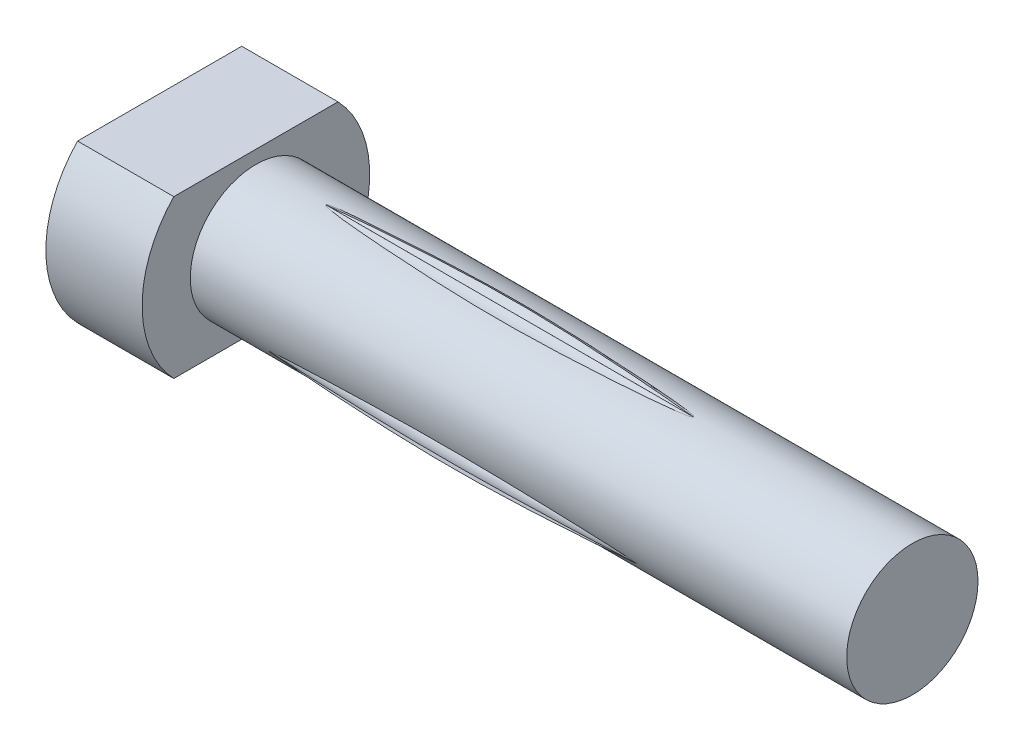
ISO-10303-21;
HEADER;
FILE_DESCRIPTION(('STEP AP214'),'2;1');
FILE_NAME('part.step','',(''),(''),'','','');
FILE_SCHEMA(('AUTOMOTIVE_DESIGN { 1 0 10303 214 1 1 1 1 }'));
ENDSEC;
DATA;
#1=APPLICATION_CONTEXT('core data for automotive mechanical design processes');
#2=APPLICATION_PROTOCOL_DEFINITION('international standard','automotive_design',2000,#1);
#3=PRODUCT_CONTEXT('',#1,'mechanical');
#4=PRODUCT('Part','Part','',(#3));
#5=PRODUCT_RELATED_PRODUCT_CATEGORY('part','',(#4));
#6=PRODUCT_DEFINITION_FORMATION('','',#4);
#7=PRODUCT_DEFINITION_CONTEXT('part definition',#1,'design');
#8=PRODUCT_DEFINITION('design','',#6,#7);
#9=PRODUCT_DEFINITION_SHAPE('','',#8);
#10=(LENGTH_UNIT() NAMED_UNIT(*) SI_UNIT(.MILLI.,.METRE.));
#11=(NAMED_UNIT(*) PLANE_ANGLE_UNIT() SI_UNIT($,.RADIAN.));
#12=(NAMED_UNIT(*) SI_UNIT($,.STERADIAN.) SOLID_ANGLE_UNIT());
#13=UNCERTAINTY_MEASURE_WITH_UNIT(LENGTH_MEASURE(1.E-05),#10,'distance_accuracy_value','');
#14=(GEOMETRIC_REPRESENTATION_CONTEXT(3) GLOBAL_UNCERTAINTY_ASSIGNED_CONTEXT((#13)) GLOBAL_UNIT_ASSIGNED_CONTEXT((#10,
#11,#12)) REPRESENTATION_CONTEXT('',''));
#15=CARTESIAN_POINT('',(0.,0.,0.));
#16=DIRECTION('',(0.,0.,1.));
#17=DIRECTION('',(1.,0.,0.));
#18=AXIS2_PLACEMENT_3D('',#15,#16,#17);
#19=CARTESIAN_POINT('',(2.032,-0.77171610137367,1.3218696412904));
#20=CARTESIAN_POINT('',(3.81000035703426,-0.724910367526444,1.2370397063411));
#21=CARTESIAN_POINT('',(7.36600249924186,-0.631298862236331,1.06737976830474));
#22=CARTESIAN_POINT('',(10.9220003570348,-0.726915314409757,1.23600833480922));
#23=CARTESIAN_POINT('',(12.7,-0.774723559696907,1.32032265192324));
#24=CARTESIAN_POINT('',(2.032,-0.728325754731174,1.3446867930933));
#25=CARTESIAN_POINT('',(3.81000035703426,-0.659311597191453,1.27211056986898));
#26=CARTESIAN_POINT('',(7.36600249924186,-0.521283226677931,1.12695806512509));
#27=CARTESIAN_POINT('',(10.9220003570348,-0.661046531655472,1.27055430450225));
#28=CARTESIAN_POINT('',(12.7,-0.73092821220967,1.34235245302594));
#29=CARTESIAN_POINT('',(2.032,-0.660592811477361,1.42590859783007));
#30=CARTESIAN_POINT('',(3.81000035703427,-0.557401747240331,1.3959689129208));
#31=CARTESIAN_POINT('',(7.36600249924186,-0.351019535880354,1.33608951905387));
#32=CARTESIAN_POINT('',(10.9220003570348,-0.558166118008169,1.3935883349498));
#33=CARTESIAN_POINT('',(12.7,-0.661739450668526,1.42233775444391));
#34=CARTESIAN_POINT('',(2.032,-0.675087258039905,1.58430143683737));
#35=CARTESIAN_POINT('',(3.81000035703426,-0.581000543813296,1.63624847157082));
#36=CARTESIAN_POINT('',(7.36600249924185,-0.392827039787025,1.74014258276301));
#37=CARTESIAN_POINT('',(10.9220003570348,-0.579856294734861,1.63402522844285));
#38=CARTESIAN_POINT('',(12.7,-0.673370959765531,1.58096652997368));
#39=CARTESIAN_POINT('',(2.032,-0.797237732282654,1.68586238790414));
#40=CARTESIAN_POINT('',(3.81000035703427,-0.767469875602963,1.78908243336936));
#41=CARTESIAN_POINT('',(7.36600249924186,-0.707934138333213,1.99552260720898));
#42=CARTESIAN_POINT('',(10.9220003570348,-0.765089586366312,1.78831886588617));
#43=CARTESIAN_POINT('',(12.7,-0.793667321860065,1.68471695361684));
#44=CARTESIAN_POINT('',(2.032,-0.955524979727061,1.67141068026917));
#45=CARTESIAN_POINT('',(3.81000035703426,-1.00741660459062,1.76545744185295));
#46=CARTESIAN_POINT('',(7.36600249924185,-1.11119989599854,1.95355104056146));
#47=CARTESIAN_POINT('',(10.9220003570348,-1.00519314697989,1.76660121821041));
#48=CARTESIAN_POINT('',(12.7,-0.952189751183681,1.67312626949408));
#49=CARTESIAN_POINT('',(2.032,-1.05714115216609,1.54919014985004));
#50=CARTESIAN_POINT('',(3.81000035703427,-1.16033411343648,1.57904682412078));
#51=CARTESIAN_POINT('',(7.36600249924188,-1.36672011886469,1.63876019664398));
#52=CARTESIAN_POINT('',(10.9220003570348,-1.15957116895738,1.58142731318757));
#53=CARTESIAN_POINT('',(12.7,-1.0559966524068,1.55276085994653));
#54=CARTESIAN_POINT('',(2.032,-1.04269523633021,1.39099191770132));
#55=CARTESIAN_POINT('',(3.81000035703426,-1.13681068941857,1.33909732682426));
#56=CARTESIAN_POINT('',(7.36600249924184,-1.32504167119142,1.23530810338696));
#57=CARTESIAN_POINT('',(10.9220003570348,-1.13795401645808,1.34132104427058));
#58=CARTESIAN_POINT('',(12.7,-1.04441015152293,1.39432753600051));
#59=CARTESIAN_POINT('',(2.032,-0.920411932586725,1.28928068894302));
#60=CARTESIAN_POINT('',(3.81000035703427,-0.950108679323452,1.18601747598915));
#61=CARTESIAN_POINT('',(7.36600249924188,-1.00950219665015,0.979490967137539));
#62=CARTESIAN_POINT('',(10.9220003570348,-0.952489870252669,1.18677993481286));
#63=CARTESIAN_POINT('',(12.7,-0.923983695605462,1.29042446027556));
#64=CARTESIAN_POINT('',(2.032,-0.815106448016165,1.2990524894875));
#65=CARTESIAN_POINT('',(3.81000035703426,-0.790509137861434,1.20196884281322));
#66=CARTESIAN_POINT('',(7.36600249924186,-0.741314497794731,1.00780147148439));
#67=CARTESIAN_POINT('',(10.9220003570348,-0.792784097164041,1.2014623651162));
#68=CARTESIAN_POINT('',(12.7,-0.818518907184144,1.29829285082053));
#69=CARTESIAN_POINT('',(2.032,-0.77171610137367,1.3218696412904));
#70=CARTESIAN_POINT('',(3.81000035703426,-0.724910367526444,1.2370397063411));
#71=CARTESIAN_POINT('',(7.36600249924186,-0.631298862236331,1.06737976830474));
#72=CARTESIAN_POINT('',(10.9220003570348,-0.726915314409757,1.23600833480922));
#73=CARTESIAN_POINT('',(12.7,-0.774723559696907,1.32032265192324));
#74=B_SPLINE_SURFACE_WITH_KNOTS('',3,3,((#19,#20,#21,#22,#23),(#24,#25,#26,#27,#28),(#29,#30,
#31,#32,#33),(#34,#35,#36,#37,#38),(#39,#40,#41,#42,#43),(#44,#45,#46,#47,#48),(#49,#50,#51,#52,
#53),(#54,#55,#56,#57,#58),(#59,#60,#61,#62,#63),(#64,#65,#66,#67,#68),(#69,#70,#71,#72,#73)),
.UNSPECIFIED.,.T.,.F.,.F.,(4,1,1,1,1,1,1,1,4),(4,1,4),(0.,0.125,0.25,0.375,0.5,0.625,0.75,0.875,
1.),(0.,0.499999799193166,1.),.UNSPECIFIED.);
#75=CARTESIAN_POINT('',(2.032,-0.957818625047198,1.64669623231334));
#76=CARTESIAN_POINT('',(2.03299917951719,-0.959214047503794,1.64588438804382));
#77=CARTESIAN_POINT('',(2.03419583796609,-0.960465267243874,1.64515443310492));
#78=CARTESIAN_POINT('',(2.03681663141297,-0.962737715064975,1.64382569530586));
#79=CARTESIAN_POINT('',(2.03823649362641,-0.963762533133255,1.6432248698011));
#80=CARTESIAN_POINT('',(2.04391711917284,-0.967468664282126,1.64104834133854));
#81=CARTESIAN_POINT('',(2.04855211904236,-0.969687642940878,1.63973678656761));
#82=CARTESIAN_POINT('',(2.05814222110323,-0.973719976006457,1.63734527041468));
#83=CARTESIAN_POINT('',(2.0631021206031,-0.975523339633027,1.63627103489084));
#84=CARTESIAN_POINT('',(2.07407904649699,-0.979166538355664,1.63409402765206));
#85=CARTESIAN_POINT('',(2.08012130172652,-0.980950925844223,1.6330230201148));
#86=CARTESIAN_POINT('',(2.09229197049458,-0.984288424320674,1.63101348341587));
#87=CARTESIAN_POINT('',(2.09842045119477,-0.985841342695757,1.63007506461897));
#88=CARTESIAN_POINT('',(2.11690330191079,-0.990267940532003,1.62739255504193));
#89=CARTESIAN_POINT('',(2.12933442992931,-0.992903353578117,1.62578487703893));
#90=CARTESIAN_POINT('',(2.15416453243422,-0.997792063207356,1.62278892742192));
#91=CARTESIAN_POINT('',(2.16656262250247,-1.00004886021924,1.6213986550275));
#92=CARTESIAN_POINT('',(2.19139949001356,-1.004319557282,1.61875678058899));
#93=CARTESIAN_POINT('',(2.20383819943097,-1.00633375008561,1.61750501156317));
#94=CARTESIAN_POINT('',(2.24109937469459,-1.01210413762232,1.61390547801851));
#95=CARTESIAN_POINT('',(2.26597427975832,-1.01560781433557,1.61170137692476));
#96=CARTESIAN_POINT('',(2.31579936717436,-1.02220195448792,1.60752700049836));
#97=CARTESIAN_POINT('',(2.3407495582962,-1.02529236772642,1.60555675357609));
#98=CARTESIAN_POINT('',(2.41570544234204,-1.03414149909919,1.59988317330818));
#99=CARTESIAN_POINT('',(2.46577940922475,-1.03947287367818,1.59642029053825));
#100=CARTESIAN_POINT('',(2.56616928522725,-1.04949481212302,1.58984931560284));
#101=CARTESIAN_POINT('',(2.6164854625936,-1.05418333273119,1.58674235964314));
#102=CARTESIAN_POINT('',(2.71715515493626,-1.06309909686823,1.5807827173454));
#103=CARTESIAN_POINT('',(2.7675086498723,-1.06732650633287,1.57792993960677));
#104=CARTESIAN_POINT('',(2.91840536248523,-1.07948926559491,1.56965749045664));
#105=CARTESIAN_POINT('',(3.01900337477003,-1.08692569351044,1.56451011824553));
#106=CARTESIAN_POINT('',(3.22028341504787,-1.10093230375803,1.5546848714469));
#107=CARTESIAN_POINT('',(3.32096544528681,-1.10750246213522,1.55000700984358));
#108=CARTESIAN_POINT('',(3.62313370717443,-1.12627634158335,1.53647867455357));
#109=CARTESIAN_POINT('',(3.82470106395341,-1.13754040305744,1.52813556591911));
#110=CARTESIAN_POINT('',(4.2276969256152,-1.15823124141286,1.51251116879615));
#111=CARTESIAN_POINT('',(4.42912525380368,-1.16766046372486,1.5052284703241));
#112=CARTESIAN_POINT('',(4.83207354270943,-1.18482759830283,1.49175333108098));
#113=CARTESIAN_POINT('',(5.03359349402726,-1.19256565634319,1.4855607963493));
#114=CARTESIAN_POINT('',(5.43679943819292,-1.20633729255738,1.47439944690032));
#115=CARTESIAN_POINT('',(5.63848546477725,-1.21237024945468,1.46943107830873));
#116=CARTESIAN_POINT('',(6.04193950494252,-1.22262315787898,1.4609114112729));
#117=CARTESIAN_POINT('',(6.24370752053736,-1.22684306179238,1.45736015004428));
#118=CARTESIAN_POINT('',(6.64733969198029,-1.23331449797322,1.45188799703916));
#119=CARTESIAN_POINT('',(6.84920385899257,-1.23556563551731,1.44996743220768));
#120=CARTESIAN_POINT('',(7.15201398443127,-1.23731181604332,1.44847669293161));
#121=CARTESIAN_POINT('',(7.2529524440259,-1.23762212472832,1.44821146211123));
#122=CARTESIAN_POINT('',(7.45482954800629,-1.23766643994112,1.44817361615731));
#123=CARTESIAN_POINT('',(7.55576819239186,-1.23740044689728,1.44840100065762));
#124=CARTESIAN_POINT('',(7.81814802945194,-1.235998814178,1.44959770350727));
#125=CARTESIAN_POINT('',(7.97958551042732,-1.23443744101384,1.45093007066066));
#126=CARTESIAN_POINT('',(8.30243010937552,-1.23002436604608,1.45467279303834));
#127=CARTESIAN_POINT('',(8.46383722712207,-1.22717265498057,1.45708315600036));
#128=CARTESIAN_POINT('',(8.94798508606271,-1.21682281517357,1.46575944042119));
#129=CARTESIAN_POINT('',(9.27066410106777,-1.20752990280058,1.47347062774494));
#130=CARTESIAN_POINT('',(9.75445998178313,-1.19033889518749,1.48733699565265));
#131=CARTESIAN_POINT('',(9.91567265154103,-1.18406738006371,1.49234179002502));
#132=CARTESIAN_POINT('',(10.2380268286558,-1.17044275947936,1.50305167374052));
#133=CARTESIAN_POINT('',(10.3991683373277,-1.16308967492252,1.50875674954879));
#134=CARTESIAN_POINT('',(10.7023452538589,-1.14817620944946,1.52012942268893));
#135=CARTESIAN_POINT('',(10.8443897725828,-1.14074284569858,1.52572188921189));
#136=CARTESIAN_POINT('',(11.1284032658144,-1.12486027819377,1.53746966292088));
#137=CARTESIAN_POINT('',(11.2703722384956,-1.116411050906,1.54362498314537));
#138=CARTESIAN_POINT('',(11.4989335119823,-1.10169847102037,1.55413385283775));
#139=CARTESIAN_POINT('',(11.5855641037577,-1.09586497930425,1.55825575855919));
#140=CARTESIAN_POINT('',(11.7587518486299,-1.08350625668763,1.56687480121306));
#141=CARTESIAN_POINT('',(11.8453090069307,-1.0769810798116,1.57137190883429));
#142=CARTESIAN_POINT('',(11.9843397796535,-1.06566867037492,1.57905086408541));
#143=CARTESIAN_POINT('',(12.0368494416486,-1.06120524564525,1.58205568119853));
#144=CARTESIAN_POINT('',(12.1418041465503,-1.05175628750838,1.58835337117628));
#145=CARTESIAN_POINT('',(12.1942491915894,-1.04677077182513,1.59164623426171));
#146=CARTESIAN_POINT('',(12.2783402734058,-1.03812102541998,1.59729292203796));
#147=CARTESIAN_POINT('',(12.3100220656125,-1.0347123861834,1.59950413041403));
#148=CARTESIAN_POINT('',(12.3733026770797,-1.02748193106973,1.60415855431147));
#149=CARTESIAN_POINT('',(12.4049015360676,-1.02366037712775,1.6066016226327));
#150=CARTESIAN_POINT('',(12.4554468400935,-1.01701395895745,1.61081228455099));
#151=CARTESIAN_POINT('',(12.4744302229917,-1.01439667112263,1.61246240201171));
#152=CARTESIAN_POINT('',(12.5123653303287,-1.00882125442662,1.61595659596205));
#153=CARTESIAN_POINT('',(12.5313169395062,-1.00586253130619,1.6178010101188));
#154=CARTESIAN_POINT('',(12.5615767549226,-1.00069401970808,1.62100018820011));
#155=CARTESIAN_POINT('',(12.572924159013,-0.998655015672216,1.6222575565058));
#156=CARTESIAN_POINT('',(12.595489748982,-0.994309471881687,1.62492469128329));
#157=CARTESIAN_POINT('',(12.606708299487,-0.992004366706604,1.6263336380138));
#158=CARTESIAN_POINT('',(12.6245124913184,-0.9879726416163,1.62878425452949));
#159=CARTESIAN_POINT('',(12.631140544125,-0.986388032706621,1.62974464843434));
#160=CARTESIAN_POINT('',(12.6444093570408,-0.982964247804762,1.63181197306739));
#161=CARTESIAN_POINT('',(12.6510489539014,-0.981121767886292,1.63292079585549));
#162=CARTESIAN_POINT('',(12.6643214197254,-0.977028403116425,1.63537354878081));
#163=CARTESIAN_POINT('',(12.670951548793,-0.974770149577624,1.63672170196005));
#164=CARTESIAN_POINT('',(12.6804857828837,-0.970823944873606,1.63906314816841));
#165=CARTESIAN_POINT('',(12.6835561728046,-0.969437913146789,1.63988358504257));
#166=CARTESIAN_POINT('',(12.6894805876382,-0.966360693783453,1.64169892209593));
#167=CARTESIAN_POINT('',(12.6923359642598,-0.964671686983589,1.64269257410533));
#168=CARTESIAN_POINT('',(12.6958775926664,-0.961936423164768,1.64429439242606));
#169=CARTESIAN_POINT('',(12.6968108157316,-0.961141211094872,1.6447594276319));
#170=CARTESIAN_POINT('',(12.6985360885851,-0.959424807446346,1.64576122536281));
#171=CARTESIAN_POINT('',(12.6993259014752,-0.958501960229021,1.64629892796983));
#172=CARTESIAN_POINT('',(12.7,-0.957505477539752,1.64687833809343));
#173=B_SPLINE_CURVE_WITH_KNOTS('',3,(#75,#76,#77,#78,#79,#80,#81,#82,#83,#84,#85,#86,#87,#88,
#89,#90,#91,#92,#93,#94,#95,#96,#97,#98,#99,#100,#101,#102,#103,#104,#105,#106,#107,#108,#109,
#110,#111,#112,#113,#114,#115,#116,#117,#118,#119,#120,#121,#122,#123,#124,#125,#126,#127,#128,
#129,#130,#131,#132,#133,#134,#135,#136,#137,#138,#139,#140,#141,#142,#143,#144,#145,#146,#147,
#148,#149,#150,#151,#152,#153,#154,#155,#156,#157,#158,#159,#160,#161,#162,#163,#164,#165,#166,
#167,#168,#169,#170,#171,#172),.UNSPECIFIED.,.F.,.F.,(4,2,2,2,2,2,2,2,2,2,2,2,2,2,2,2,2,2,2,2,2,
2,2,2,2,2,2,2,2,2,2,2,2,2,2,2,2,2,2,2,2,2,2,2,2,2,2,2,4),(0.,0.00562593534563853,
0.0111549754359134,0.0269627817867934,0.0431181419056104,0.0622743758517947,0.0814464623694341,
0.11985605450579,0.157888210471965,0.195874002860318,0.271516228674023,0.347167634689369,
0.498583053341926,0.650469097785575,0.802300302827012,1.10530294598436,1.40831396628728,
2.0144596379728,2.61979183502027,3.2250718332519,3.83057208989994,4.43608824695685,
5.04172577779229,5.34454117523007,5.64735634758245,6.13169728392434,6.61604169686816,
7.58469522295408,8.06892871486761,8.55315284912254,8.98019571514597,9.4072484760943,
9.6680200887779,9.92877134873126,10.0871233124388,10.2454699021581,10.341291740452,
10.4370531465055,10.4947526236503,10.5525540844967,10.5873438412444,10.6219541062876,
10.6425956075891,10.6635310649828,10.6848813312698,10.6952766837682,10.7056000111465,
10.7095207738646,10.7134982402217),.UNSPECIFIED.);
#174=CARTESIAN_POINT('',(2.032,-0.952198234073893,1.6500151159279));
#175=VERTEX_POINT('',#174);
#176=CARTESIAN_POINT('',(12.7,-0.952277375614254,1.64993507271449));
#177=VERTEX_POINT('',#176);
#178=EDGE_CURVE('E163',#175,#177,#173,.T.);
#179=CARTESIAN_POINT('',(12.7,-0.95263505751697,1.64981457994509));
#180=CARTESIAN_POINT('',(12.6405428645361,-0.957043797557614,1.6509959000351));
#181=CARTESIAN_POINT('',(12.5810770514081,-0.961340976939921,1.65214732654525));
#182=CARTESIAN_POINT('',(12.4621325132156,-0.969753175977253,1.65440136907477));
#183=CARTESIAN_POINT('',(12.4026537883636,-0.973868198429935,1.65550398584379));
#184=CARTESIAN_POINT('',(12.1052304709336,-0.994090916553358,1.66092264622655));
#185=CARTESIAN_POINT('',(11.8672086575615,-1.00914058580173,1.6649551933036));
#186=CARTESIAN_POINT('',(11.3910525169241,-1.03763991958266,1.67259156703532));
#187=CARTESIAN_POINT('',(11.1529181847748,-1.05108950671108,1.6761953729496));
#188=CARTESIAN_POINT('',(10.6765050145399,-1.07630464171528,1.68295174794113));
#189=CARTESIAN_POINT('',(10.4382261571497,-1.0880698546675,1.68610422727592));
#190=CARTESIAN_POINT('',(9.96157419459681,-1.10965275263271,1.6918873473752));
#191=CARTESIAN_POINT('',(9.72320108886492,-1.1194704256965,1.69451798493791));
#192=CARTESIAN_POINT('',(9.00797594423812,-1.1454830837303,1.70148805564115));
#193=CARTESIAN_POINT('',(8.53097371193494,-1.15824017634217,1.70490630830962));
#194=CARTESIAN_POINT('',(7.80310704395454,-1.16810062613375,1.70754840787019));
#195=CARTESIAN_POINT('',(7.55230782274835,-1.16975895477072,1.70799275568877));
#196=CARTESIAN_POINT('',(7.05071412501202,-1.16911013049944,1.70781890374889));
#197=CARTESIAN_POINT('',(6.79991964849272,-1.16680296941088,1.70720070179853));
#198=CARTESIAN_POINT('',(6.17246375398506,-1.1568088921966,1.70452279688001));
#199=CARTESIAN_POINT('',(5.79583965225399,-1.14700223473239,1.70189511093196));
#200=CARTESIAN_POINT('',(5.04279242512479,-1.12142772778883,1.69504244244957));
#201=CARTESIAN_POINT('',(4.66636931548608,-1.10565946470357,1.69081734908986));
#202=CARTESIAN_POINT('',(4.10174633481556,-1.07856091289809,1.68355631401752));
#203=CARTESIAN_POINT('',(3.91345520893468,-1.06894855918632,1.68098069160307));
#204=CARTESIAN_POINT('',(3.53693330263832,-1.04868102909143,1.67555002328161));
#205=CARTESIAN_POINT('',(3.34870252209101,-1.03802585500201,1.67269497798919));
#206=CARTESIAN_POINT('',(2.97233760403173,-1.01570147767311,1.66671317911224));
#207=CARTESIAN_POINT('',(2.7842034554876,-1.00403244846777,1.66358647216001));
#208=CARTESIAN_POINT('',(2.50206616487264,-0.985609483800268,1.65865005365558));
#209=CARTESIAN_POINT('',(2.40803092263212,-0.979315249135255,1.65696351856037));
#210=CARTESIAN_POINT('',(2.2199904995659,-0.966315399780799,1.65348021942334));
#211=CARTESIAN_POINT('',(2.12598531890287,-0.959609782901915,1.65168345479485));
#212=CARTESIAN_POINT('',(2.03200000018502,-0.952646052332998,1.64981752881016));
#213=B_SPLINE_CURVE_WITH_KNOTS('',3,(#179,#180,#181,#182,#183,#184,#185,#186,#187,#188,#189,
#190,#191,#192,#193,#194,#195,#196,#197,#198,#199,#200,#201,#202,#203,#204,#205,#206,#207,#208,
#209,#210,#211,#212),.UNSPECIFIED.,.F.,.F.,(4,2,2,2,2,2,2,2,2,2,2,2,2,2,2,2,4),(0.,
0.178895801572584,0.357788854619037,1.07337295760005,1.78899166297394,2.50475246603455,
3.22051766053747,4.65191474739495,5.40430082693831,6.15668845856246,7.28690195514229,
8.41719387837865,8.98285328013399,9.54851143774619,10.1140726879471,10.3968541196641,
10.6796370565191),.UNSPECIFIED.);
#214=EDGE_CURVE('E13',#177,#175,#213,.T.);
#215=ORIENTED_EDGE('',*,*,#178,.T.);
#216=ORIENTED_EDGE('',*,*,#214,.T.);
#217=EDGE_LOOP('',(#215,#216));
#218=FACE_BOUND('',#217,.T.);
#219=ADVANCED_FACE('F76',(#218),#74,.T.);
#220=CARTESIAN_POINT('',(12.7,-0.946569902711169,1.65318795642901));
#221=CARTESIAN_POINT('',(12.6990886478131,-0.945247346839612,1.65394506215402));
#222=CARTESIAN_POINT('',(12.6979896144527,-0.944056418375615,1.65462502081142));
#223=CARTESIAN_POINT('',(12.6955740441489,-0.94188792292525,1.65586043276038));
#224=CARTESIAN_POINT('',(12.6942617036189,-0.940906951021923,1.65641787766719));
#225=CARTESIAN_POINT('',(12.6890736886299,-0.937404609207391,1.65840481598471));
#226=CARTESIAN_POINT('',(12.6848490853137,-0.935300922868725,1.65959100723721));
#227=CARTESIAN_POINT('',(12.6760970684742,-0.931468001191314,1.66174513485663));
#228=CARTESIAN_POINT('',(12.6715650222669,-0.929748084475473,1.66270765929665));
#229=CARTESIAN_POINT('',(12.66158599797,-0.926285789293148,1.66463938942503));
#230=CARTESIAN_POINT('',(12.6561166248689,-0.924591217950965,1.66558081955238));
#231=CARTESIAN_POINT('',(12.6450962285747,-0.921414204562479,1.66734041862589));
#232=CARTESIAN_POINT('',(12.6395451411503,-0.919931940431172,1.66815848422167));
#233=CARTESIAN_POINT('',(12.6227997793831,-0.915698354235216,1.67048857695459));
#234=CARTESIAN_POINT('',(12.6115325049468,-0.913166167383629,1.67187320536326));
#235=CARTESIAN_POINT('',(12.5890209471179,-0.908454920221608,1.67443769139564));
#236=CARTESIAN_POINT('',(12.5777774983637,-0.906272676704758,1.67561940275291));
#237=CARTESIAN_POINT('',(12.5552511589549,-0.902132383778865,1.67785210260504));
#238=CARTESIAN_POINT('',(12.5439683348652,-0.900174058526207,1.67890325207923));
#239=CARTESIAN_POINT('',(12.510170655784,-0.894551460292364,1.68190988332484));
#240=CARTESIAN_POINT('',(12.4876055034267,-0.891119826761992,1.68372924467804));
#241=CARTESIAN_POINT('',(12.4424029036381,-0.884636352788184,1.68714452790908));
#242=CARTESIAN_POINT('',(12.4197654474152,-0.881584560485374,1.68874042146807));
#243=CARTESIAN_POINT('',(12.3517529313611,-0.872815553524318,1.69329915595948));
#244=CARTESIAN_POINT('',(12.306312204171,-0.867489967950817,1.69603025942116));
#245=CARTESIAN_POINT('',(12.2152199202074,-0.857422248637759,1.70114177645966));
#246=CARTESIAN_POINT('',(12.1695681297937,-0.852681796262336,1.70352118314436));
#247=CARTESIAN_POINT('',(12.0782270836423,-0.843618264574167,1.70802774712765));
#248=CARTESIAN_POINT('',(12.0325378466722,-0.839295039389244,1.71015499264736));
#249=CARTESIAN_POINT('',(11.8956396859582,-0.826796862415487,1.7162512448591));
#250=CARTESIAN_POINT('',(11.8043780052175,-0.819070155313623,1.71994646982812));
#251=CARTESIAN_POINT('',(11.6217637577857,-0.804384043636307,1.7268631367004));
#252=CARTESIAN_POINT('',(11.5304111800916,-0.797424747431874,1.73008451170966));
#253=CARTESIAN_POINT('',(11.3477690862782,-0.78409917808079,1.73616448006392));
#254=CARTESIAN_POINT('',(11.2564796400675,-0.777732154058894,1.73902353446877));
#255=CARTESIAN_POINT('',(11.0738648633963,-0.765472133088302,1.74445468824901));
#256=CARTESIAN_POINT('',(10.9825395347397,-0.759579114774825,1.74702680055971));
#257=CARTESIAN_POINT('',(10.7084387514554,-0.742504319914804,1.75438497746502));
#258=CARTESIAN_POINT('',(10.525615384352,-0.731932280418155,1.75881041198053));
#259=CARTESIAN_POINT('',(10.1598688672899,-0.712254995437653,1.76687010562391));
#260=CARTESIAN_POINT('',(9.97694571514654,-0.703149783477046,1.77050434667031));
#261=CARTESIAN_POINT('',(9.61094247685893,-0.686453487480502,1.7770444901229));
#262=CARTESIAN_POINT('',(9.42786235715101,-0.67886301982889,1.77995009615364));
#263=CARTESIAN_POINT('',(9.06163189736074,-0.66532913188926,1.78505305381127));
#264=CARTESIAN_POINT('',(8.87848155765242,-0.659385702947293,1.7872504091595));
#265=CARTESIAN_POINT('',(8.51211940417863,-0.649325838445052,1.79092986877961));
#266=CARTESIAN_POINT('',(8.32890758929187,-0.64520943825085,1.79241195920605));
#267=CARTESIAN_POINT('',(7.96244523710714,-0.638993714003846,1.79463728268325));
#268=CARTESIAN_POINT('',(7.77919470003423,-0.636894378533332,1.79538051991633));
#269=CARTESIAN_POINT('',(7.41270485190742,-0.634989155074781,1.79605544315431));
#270=CARTESIAN_POINT('',(7.22946554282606,-0.635182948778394,1.79598724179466));
#271=CARTESIAN_POINT('',(6.8630056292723,-0.637817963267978,1.7950528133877));
#272=CARTESIAN_POINT('',(6.67978502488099,-0.640259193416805,1.79418658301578));
#273=CARTESIAN_POINT('',(6.20456879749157,-0.649166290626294,1.79098953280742));
#274=CARTESIAN_POINT('',(5.91260536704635,-0.657161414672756,1.78809439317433));
#275=CARTESIAN_POINT('',(5.32884377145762,-0.677426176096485,1.78051541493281));
#276=CARTESIAN_POINT('',(5.03704561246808,-0.689695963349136,1.77583151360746));
#277=CARTESIAN_POINT('',(4.56387188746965,-0.712658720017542,1.76670080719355));
#278=CARTESIAN_POINT('',(4.38242780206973,-0.722196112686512,1.76283297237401));
#279=CARTESIAN_POINT('',(4.01964164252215,-0.742731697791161,1.75428040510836));
#280=CARTESIAN_POINT('',(3.83829956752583,-0.753729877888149,1.7495956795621));
#281=CARTESIAN_POINT('',(3.54672272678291,-0.77281506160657,1.74121897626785));
#282=CARTESIAN_POINT('',(3.43644265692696,-0.780356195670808,1.73785631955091));
#283=CARTESIAN_POINT('',(3.21596465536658,-0.796257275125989,1.73062893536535));
#284=CARTESIAN_POINT('',(3.1057667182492,-0.804617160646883,1.72676424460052));
#285=CARTESIAN_POINT('',(2.92920994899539,-0.818953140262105,1.71999299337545));
#286=CARTESIAN_POINT('',(2.86281227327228,-0.824558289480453,1.71731502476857));
#287=CARTESIAN_POINT('',(2.73008386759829,-0.836347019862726,1.71160514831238));
#288=CARTESIAN_POINT('',(2.6637531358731,-0.842530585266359,1.70857325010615));
#289=CARTESIAN_POINT('',(2.55771157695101,-0.853139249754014,1.70329031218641));
#290=CARTESIAN_POINT('',(2.51796366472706,-0.857278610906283,1.7012119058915));
#291=CARTESIAN_POINT('',(2.43855603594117,-0.866008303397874,1.69678488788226));
#292=CARTESIAN_POINT('',(2.39889627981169,-0.870598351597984,1.69443644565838));
#293=CARTESIAN_POINT('',(2.3356485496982,-0.878502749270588,1.69034576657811));
#294=CARTESIAN_POINT('',(2.31202297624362,-0.881586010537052,1.68874049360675));
#295=CARTESIAN_POINT('',(2.26479493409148,-0.888123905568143,1.68531149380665));
#296=CARTESIAN_POINT('',(2.24119257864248,-0.891579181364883,1.6834873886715));
#297=CARTESIAN_POINT('',(2.20361760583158,-0.897564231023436,1.68030049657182));
#298=CARTESIAN_POINT('',(2.18960559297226,-0.899904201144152,1.67904892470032));
#299=CARTESIAN_POINT('',(2.16172163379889,-0.904873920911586,1.67637592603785));
#300=CARTESIAN_POINT('',(2.1478493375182,-0.907502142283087,1.67495539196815));
#301=CARTESIAN_POINT('',(2.12589078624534,-0.912065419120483,1.67247283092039));
#302=CARTESIAN_POINT('',(2.11776246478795,-0.913843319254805,1.67150235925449));
#303=CARTESIAN_POINT('',(2.10147162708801,-0.917674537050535,1.66940206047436));
#304=CARTESIAN_POINT('',(2.09331021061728,-0.919731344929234,1.66827020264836));
#305=CARTESIAN_POINT('',(2.07697354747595,-0.924283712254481,1.66575266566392));
#306=CARTESIAN_POINT('',(2.06880067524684,-0.926786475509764,1.66436280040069));
#307=CARTESIAN_POINT('',(2.05696863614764,-0.931160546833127,1.66191683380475));
#308=CARTESIAN_POINT('',(2.05314609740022,-0.932696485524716,1.66105565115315));
#309=CARTESIAN_POINT('',(2.04571757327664,-0.936114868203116,1.65913171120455));
#310=CARTESIAN_POINT('',(2.04211041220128,-0.937995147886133,1.65807021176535));
#311=CARTESIAN_POINT('',(2.03751397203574,-0.941124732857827,1.65629413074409));
#312=CARTESIAN_POINT('',(2.03626263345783,-0.942066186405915,1.6557589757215));
#313=CARTESIAN_POINT('',(2.03395026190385,-0.944134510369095,1.65458042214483));
#314=CARTESIAN_POINT('',(2.03289242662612,-0.945263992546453,1.65393549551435));
#315=CARTESIAN_POINT('',(2.032,-0.946510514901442,1.65322195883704));
#316=B_SPLINE_CURVE_WITH_KNOTS('',3,(#220,#221,#222,#223,#224,#225,#226,#227,#228,#229,#230,
#231,#232,#233,#234,#235,#236,#237,#238,#239,#240,#241,#242,#243,#244,#245,#246,#247,#248,#249,
#250,#251,#252,#253,#254,#255,#256,#257,#258,#259,#260,#261,#262,#263,#264,#265,#266,#267,#268,
#269,#270,#271,#272,#273,#274,#275,#276,#277,#278,#279,#280,#281,#282,#283,#284,#285,#286,#287,
#288,#289,#290,#291,#292,#293,#294,#295,#296,#297,#298,#299,#300,#301,#302,#303,#304,#305,#306,
#307,#308,#309,#310,#311,#312,#313,#314,#315),.UNSPECIFIED.,.F.,.F.,(4,2,2,2,2,2,2,2,2,2,2,2,2,
2,2,2,2,2,2,2,2,2,2,2,2,2,2,2,2,2,2,2,2,2,2,2,2,2,2,2,2,2,2,2,2,2,2,4),(0.,0.00526160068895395,
0.0104300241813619,0.0249327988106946,0.0397565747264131,0.057150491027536,0.0745588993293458,
0.109436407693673,0.143976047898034,0.1784726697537,0.247155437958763,0.315846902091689,
0.453334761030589,0.591208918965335,0.729034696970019,1.00401486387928,1.27903381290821,
1.55369920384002,1.82835220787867,2.37788956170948,2.92743947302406,3.47721255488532,
4.0269827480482,4.57676358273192,5.12654130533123,5.67624271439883,6.22594641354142,
7.10216264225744,7.97840959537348,8.52361079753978,9.0688073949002,9.40057106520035,
9.73231049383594,9.93237145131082,10.1324269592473,10.25247570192,10.3724495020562,
10.4440872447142,10.5158506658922,10.5586312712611,10.6011951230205,10.6263209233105,
10.6517965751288,10.677728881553,10.6903491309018,10.7028926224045,10.7078369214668,
10.7128567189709),.UNSPECIFIED.);
#317=EDGE_CURVE('E166',#177,#175,#316,.T.);
#318=CARTESIAN_POINT('',(2.032,-0.952460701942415,1.64992503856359));
#319=CARTESIAN_POINT('',(2.09145534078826,-0.951272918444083,1.65435791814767));
#320=CARTESIAN_POINT('',(2.15091985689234,-0.950116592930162,1.65867338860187));
#321=CARTESIAN_POINT('',(2.26986230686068,-0.947854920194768,1.66711406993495));
#322=CARTESIAN_POINT('',(2.32934024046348,-0.946749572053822,1.67123928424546));
#323=CARTESIAN_POINT('',(2.62676022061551,-0.94132025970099,1.69150174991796));
#324=CARTESIAN_POINT('',(2.8647820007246,-0.937288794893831,1.70654738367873));
#325=CARTESIAN_POINT('',(3.34093991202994,-0.929656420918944,1.73503179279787));
#326=CARTESIAN_POINT('',(3.57907604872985,-0.926055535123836,1.7484704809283));
#327=CARTESIAN_POINT('',(4.0554941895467,-0.919305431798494,1.77366220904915));
#328=CARTESIAN_POINT('',(4.29377621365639,-0.916156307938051,1.78541489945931));
#329=CARTESIAN_POINT('',(4.77043421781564,-0.910378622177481,1.80697751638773));
#330=CARTESIAN_POINT('',(5.00881019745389,-0.907750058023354,1.81678745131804));
#331=CARTESIAN_POINT('',(5.48563373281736,-0.903109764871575,1.83410526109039));
#332=CARTESIAN_POINT('',(5.72408128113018,-0.901097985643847,1.84161332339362));
#333=CARTESIAN_POINT('',(6.20105028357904,-0.897798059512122,1.85392881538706));
#334=CARTESIAN_POINT('',(6.43957173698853,-0.896509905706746,1.85873627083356));
#335=CARTESIAN_POINT('',(6.9289819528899,-0.894734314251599,1.86536286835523));
#336=CARTESIAN_POINT('',(7.17987331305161,-0.894291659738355,1.86701487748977));
#337=CARTESIAN_POINT('',(7.68165096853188,-0.894468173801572,1.86635611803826));
#338=CARTESIAN_POINT('',(7.93253726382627,-0.895087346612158,1.86404533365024));
#339=CARTESIAN_POINT('',(8.43426605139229,-0.897229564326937,1.85605046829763));
#340=CARTESIAN_POINT('',(8.685108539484,-0.898752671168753,1.85036615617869));
#341=CARTESIAN_POINT('',(9.18670471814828,-0.902571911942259,1.83611255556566));
#342=CARTESIAN_POINT('',(9.43745840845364,-0.904868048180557,1.82754325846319));
#343=CARTESIAN_POINT('',(9.93934229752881,-0.910114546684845,1.80796305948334));
#344=CARTESIAN_POINT('',(10.190472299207,-0.91306615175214,1.79694751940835));
#345=CARTESIAN_POINT('',(10.6926141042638,-0.919515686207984,1.77287752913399));
#346=CARTESIAN_POINT('',(10.9436259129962,-0.923013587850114,1.75982318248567));
#347=CARTESIAN_POINT('',(11.3200993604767,-0.928624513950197,1.73888292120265));
#348=CARTESIAN_POINT('',(11.44560191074,-0.930555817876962,1.7316751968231));
#349=CARTESIAN_POINT('',(11.6965772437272,-0.934542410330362,1.71679703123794));
#350=CARTESIAN_POINT('',(11.8220500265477,-0.936597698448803,1.70912659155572));
#351=CARTESIAN_POINT('',(12.0729662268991,-0.94084180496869,1.69328737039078));
#352=CARTESIAN_POINT('',(12.1984096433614,-0.943030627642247,1.68511857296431));
#353=CARTESIAN_POINT('',(12.4492467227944,-0.947594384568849,1.66808640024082));
#354=CARTESIAN_POINT('',(12.5746403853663,-0.949969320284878,1.65922301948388));
#355=CARTESIAN_POINT('',(12.6999999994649,-0.952463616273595,1.64991418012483));
#356=B_SPLINE_CURVE_WITH_KNOTS('',3,(#318,#319,#320,#321,#322,#323,#324,#325,#326,#327,#328,
#329,#330,#331,#332,#333,#334,#335,#336,#337,#338,#339,#340,#341,#342,#343,#344,#345,#346,#347,
#348,#349,#350,#351,#352,#353,#354,#355),.UNSPECIFIED.,.F.,.F.,(4,2,2,2,2,2,2,2,2,2,2,2,2,2,2,2,
2,2,4),(0.,0.178896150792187,0.357789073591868,1.07337199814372,1.78899374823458,
2.50476366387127,3.22053048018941,3.93623898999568,4.65194067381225,5.40460046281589,
6.15726325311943,6.90997762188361,7.66269423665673,8.41685041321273,9.17096829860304,
9.5481401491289,9.92531075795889,10.3024934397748,10.679679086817),.UNSPECIFIED.);
#357=EDGE_CURVE('E91',#175,#177,#356,.T.);
#358=ORIENTED_EDGE('',*,*,#317,.T.);
#359=ORIENTED_EDGE('',*,*,#357,.T.);
#360=EDGE_LOOP('',(#358,#359));
#361=FACE_BOUND('',#360,.T.);
#362=ADVANCED_FACE('F191',(#361),#74,.T.);
#363=CARTESIAN_POINT('',(2.032,-0.758914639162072,-1.32926056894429));
#364=CARTESIAN_POINT('',(3.81000035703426,-0.708852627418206,-1.24631064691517));
#365=CARTESIAN_POINT('',(7.36600249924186,-0.608728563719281,-1.08041073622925));
#366=CARTESIAN_POINT('',(10.9220003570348,-0.706956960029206,-1.24753129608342));
#367=CARTESIAN_POINT('',(12.7,-0.756071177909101,-1.33109160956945));
#368=CARTESIAN_POINT('',(2.032,-0.800370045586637,-1.30309200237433));
#369=CARTESIAN_POINT('',(3.81000035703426,-0.7720242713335,-1.20703587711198));
#370=CARTESIAN_POINT('',(7.36600249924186,-0.715332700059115,-1.01492354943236));
#371=CARTESIAN_POINT('',(10.9220003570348,-0.769809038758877,-1.20776024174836));
#372=CARTESIAN_POINT('',(12.7,-0.79704721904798,-1.30417862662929));
#373=CARTESIAN_POINT('',(2.032,-0.904576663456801,-1.28504445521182));
#374=CARTESIAN_POINT('',(3.81000035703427,-0.930243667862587,-1.18070852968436));
#375=CARTESIAN_POINT('',(7.36600249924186,-0.981577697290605,-0.97203659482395));
#376=CARTESIAN_POINT('',(10.9220003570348,-0.92779984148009,-1.18018020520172));
#377=CARTESIAN_POINT('',(12.7,-0.900910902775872,-1.28425205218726));
#378=CARTESIAN_POINT('',(2.032,-1.03450166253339,-1.37679343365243));
#379=CARTESIAN_POINT('',(3.81000035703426,-1.12653247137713,-1.3212854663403));
#380=CARTESIAN_POINT('',(7.36600249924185,-1.31059416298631,-1.21026948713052));
#381=CARTESIAN_POINT('',(10.9220003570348,-1.12517921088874,-1.31918289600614));
#382=CARTESIAN_POINT('',(12.7,-1.03247169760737,-1.37363962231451));
#383=CARTESIAN_POINT('',(2.032,-1.06138078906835,-1.53335932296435));
#384=CARTESIAN_POINT('',(3.81000035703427,-1.16565589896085,-1.55918962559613));
#385=CARTESIAN_POINT('',(7.36600249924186,-1.37420620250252,-1.6108502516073));
#386=CARTESIAN_POINT('',(10.9220003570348,-1.16618477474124,-1.55674645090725));
#387=CARTESIAN_POINT('',(12.7,-1.06217401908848,-1.5296945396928));
#388=CARTESIAN_POINT('',(2.032,-0.969721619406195,-1.66321424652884));
#389=CARTESIAN_POINT('',(3.81000035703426,-1.02522269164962,-1.75517709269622));
#390=CARTESIAN_POINT('',(7.36600249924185,-1.13622488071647,-1.9391028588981));
#391=CARTESIAN_POINT('',(10.9220003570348,-1.0273249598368,-1.75382341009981));
#392=CARTESIAN_POINT('',(12.7,-0.97287497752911,-1.66118364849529));
#393=CARTESIAN_POINT('',(2.032,-0.813067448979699,-1.69010616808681));
#394=CARTESIAN_POINT('',(3.81000035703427,-0.787327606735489,-1.79440223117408));
#395=CARTESIAN_POINT('',(7.36600249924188,-0.735847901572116,-2.0029944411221));
#396=CARTESIAN_POINT('',(10.9220003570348,-0.789770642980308,-1.79493174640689));
#397=CARTESIAN_POINT('',(12.7,-0.816732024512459,-1.69090035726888));
#398=CARTESIAN_POINT('',(2.032,-0.683286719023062,-1.59849652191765));
#399=CARTESIAN_POINT('',(3.81000035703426,-0.591286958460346,-1.65405559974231));
#400=CARTESIAN_POINT('',(7.36600249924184,-0.407287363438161,-1.76517380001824));
#401=CARTESIAN_POINT('',(10.9220003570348,-0.592641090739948,-1.65615760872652));
#402=CARTESIAN_POINT('',(12.7,-0.685317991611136,-1.60164949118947));
#403=CARTESIAN_POINT('',(2.032,-0.656343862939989,-1.44174046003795));
#404=CARTESIAN_POINT('',(3.81000035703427,-0.552066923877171,-1.41582699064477));
#405=CARTESIAN_POINT('',(7.36600249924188,-0.343512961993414,-1.364000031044));
#406=CARTESIAN_POINT('',(10.9220003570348,-0.551536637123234,-1.41827039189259));
#407=CARTESIAN_POINT('',(12.7,-0.65554851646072,-1.44540558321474));
#408=CARTESIAN_POINT('',(2.032,-0.717459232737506,-1.35542913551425));
#409=CARTESIAN_POINT('',(3.81000035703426,-0.645680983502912,-1.28558541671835));
#410=CARTESIAN_POINT('',(7.36600249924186,-0.502124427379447,-1.14589792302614));
#411=CARTESIAN_POINT('',(10.9220003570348,-0.644104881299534,-1.28730235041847));
#412=CARTESIAN_POINT('',(12.7,-0.715095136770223,-1.35800459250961));
#413=CARTESIAN_POINT('',(2.032,-0.758914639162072,-1.32926056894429));
#414=CARTESIAN_POINT('',(3.81000035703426,-0.708852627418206,-1.24631064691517));
#415=CARTESIAN_POINT('',(7.36600249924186,-0.608728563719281,-1.08041073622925));
#416=CARTESIAN_POINT('',(10.9220003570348,-0.706956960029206,-1.24753129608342));
#417=CARTESIAN_POINT('',(12.7,-0.756071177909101,-1.33109160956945));
#418=B_SPLINE_SURFACE_WITH_KNOTS('',3,3,((#363,#364,#365,#366,#367),(#368,#369,#370,#371,#372),
(#373,#374,#375,#376,#377),(#378,#379,#380,#381,#382),(#383,#384,#385,#386,#387),(#388,#389,
#390,#391,#392),(#393,#394,#395,#396,#397),(#398,#399,#400,#401,#402),(#403,#404,#405,#406,
#407),(#408,#409,#410,#411,#412),(#413,#414,#415,#416,#417)),.UNSPECIFIED.,.T.,.F.,.F.,(4,1,1,1,
1,1,1,1,4),(4,1,4),(0.,0.125,0.25,0.375,0.5,0.625,0.75,0.875,1.),(0.,0.499999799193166,1.),.UNSPECIFIED.);
#419=CARTESIAN_POINT('',(2.032,-0.947171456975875,-1.65284337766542));
#420=CARTESIAN_POINT('',(2.03299917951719,-0.94577066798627,-1.65364592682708));
#421=CARTESIAN_POINT('',(2.03419583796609,-0.944512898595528,-1.65436453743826));
#422=CARTESIAN_POINT('',(2.03681663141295,-0.942225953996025,-1.65566816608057));
#423=CARTESIAN_POINT('',(2.03823649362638,-0.941193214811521,-1.65625527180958));
#424=CARTESIAN_POINT('',(2.04391711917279,-0.937455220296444,-1.65837661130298));
#425=CARTESIAN_POINT('',(2.04855211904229,-0.935209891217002,-1.65964252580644));
#426=CARTESIAN_POINT('',(2.05814222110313,-0.931122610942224,-1.66193887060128));
#427=CARTESIAN_POINT('',(2.06310212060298,-0.929290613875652,-1.66296351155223));
#428=CARTESIAN_POINT('',(2.07407904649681,-0.925583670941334,-1.66503011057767));
#429=CARTESIAN_POINT('',(2.08012130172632,-0.923763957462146,-1.66603993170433));
#430=CARTESIAN_POINT('',(2.09229197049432,-0.920354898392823,-1.66792552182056));
#431=CARTESIAN_POINT('',(2.09842045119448,-0.918765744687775,-1.66880117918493));
#432=CARTESIAN_POINT('',(2.11690330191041,-0.914229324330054,-1.67129347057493));
#433=CARTESIAN_POINT('',(2.12933442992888,-0.911519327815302,-1.67277196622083));
#434=CARTESIAN_POINT('',(2.15416453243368,-0.906480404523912,-1.67550773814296));
#435=CARTESIAN_POINT('',(2.16656262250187,-0.904147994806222,-1.67676704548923));
#436=CARTESIAN_POINT('',(2.19139949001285,-0.899724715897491,-1.67914464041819));
#437=CARTESIAN_POINT('',(2.2038381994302,-0.897633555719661,-1.68026309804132));
#438=CARTESIAN_POINT('',(2.24109937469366,-0.891631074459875,-1.68346063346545));
#439=CARTESIAN_POINT('',(2.26597427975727,-0.887970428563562,-1.68539285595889));
#440=CARTESIAN_POINT('',(2.31579936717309,-0.881058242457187,-1.68901636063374));
#441=CARTESIAN_POINT('',(2.34074955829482,-0.877806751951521,-1.69070761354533));
#442=CARTESIAN_POINT('',(2.41570544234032,-0.868468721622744,-1.69553439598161));
#443=CARTESIAN_POINT('',(2.46577940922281,-0.862804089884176,-1.69842006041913));
#444=CARTESIAN_POINT('',(2.56616928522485,-0.852102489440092,-1.70381382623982));
#445=CARTESIAN_POINT('',(2.61648546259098,-0.847067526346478,-1.7063207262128));
#446=CARTESIAN_POINT('',(2.7171551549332,-0.837448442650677,-1.71106218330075));
#447=CARTESIAN_POINT('',(2.76750864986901,-0.832864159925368,-1.71329683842));
#448=CARTESIAN_POINT('',(2.91840536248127,-0.819618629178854,-1.71969387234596));
#449=CARTESIAN_POINT('',(3.01900337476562,-0.811442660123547,-1.72356032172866));
#450=CARTESIAN_POINT('',(3.22028341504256,-0.795930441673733,-1.73077777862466));
#451=CARTESIAN_POINT('',(3.32096544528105,-0.788594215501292,-1.73412877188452));
#452=CARTESIAN_POINT('',(3.62313370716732,-0.767491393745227,-1.74362326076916));
#453=CARTESIAN_POINT('',(3.82470106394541,-0.754634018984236,-1.74920666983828));
#454=CARTESIAN_POINT('',(4.2276969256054,-0.730757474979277,-1.75931326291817));
#455=CARTESIAN_POINT('',(4.42912525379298,-0.719735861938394,-1.76383785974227));
#456=CARTESIAN_POINT('',(4.83207354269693,-0.699482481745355,-1.77196746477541));
#457=CARTESIAN_POINT('',(5.03359349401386,-0.690250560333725,-1.77557255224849));
#458=CARTESIAN_POINT('',(5.43679943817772,-0.673698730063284,-1.78191846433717));
#459=CARTESIAN_POINT('',(5.63848546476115,-0.666379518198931,-1.78465897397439));
#460=CARTESIAN_POINT('',(6.04193950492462,-0.653874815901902,-1.78927841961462));
#461=CARTESIAN_POINT('',(6.24370752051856,-0.648689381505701,-1.79115733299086));
#462=CARTESIAN_POINT('',(6.64733969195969,-0.640714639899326,-1.79402568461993));
#463=CARTESIAN_POINT('',(6.84920385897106,-0.637925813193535,-1.79501494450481));
#464=CARTESIAN_POINT('',(7.15201398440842,-0.635761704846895,-1.79578181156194));
#465=CARTESIAN_POINT('',(7.2529524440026,-0.63537685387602,-1.79591793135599));
#466=CARTESIAN_POINT('',(7.45482954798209,-0.635321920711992,-1.79593738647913));
#467=CARTESIAN_POINT('',(7.55576819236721,-0.635651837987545,-1.79582072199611));
#468=CARTESIAN_POINT('',(7.81814802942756,-0.63738902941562,-1.79520522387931));
#469=CARTESIAN_POINT('',(7.97958551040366,-0.639323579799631,-1.79451921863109));
#470=CARTESIAN_POINT('',(8.30243010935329,-0.644771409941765,-1.79256874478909));
#471=CARTESIAN_POINT('',(8.46383722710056,-0.648284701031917,-1.79130427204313));
#472=CARTESIAN_POINT('',(8.94798508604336,-0.660973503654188,-1.78667919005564));
#473=CARTESIAN_POINT('',(9.27066410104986,-0.672298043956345,-1.78248688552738));
#474=CARTESIAN_POINT('',(9.75445998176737,-0.692902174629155,-1.77453222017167));
#475=CARTESIAN_POINT('',(9.91567265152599,-0.700372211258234,-1.77160332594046));
#476=CARTESIAN_POINT('',(10.2380268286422,-0.716459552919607,-1.76515900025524));
#477=CARTESIAN_POINT('',(10.3991683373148,-0.725076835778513,-1.76164358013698));
#478=CARTESIAN_POINT('',(10.7023452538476,-0.742382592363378,-1.75441447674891));
#479=CARTESIAN_POINT('',(10.8443897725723,-0.750942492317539,-1.75077322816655));
#480=CARTESIAN_POINT('',(11.1284032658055,-0.769057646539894,-1.74289240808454));
#481=CARTESIAN_POINT('',(11.2703722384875,-0.778612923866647,-1.73865282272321));
#482=CARTESIAN_POINT('',(11.4989335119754,-0.795070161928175,-1.73116578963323));
#483=CARTESIAN_POINT('',(11.5855641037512,-0.801556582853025,-1.72817479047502));
#484=CARTESIAN_POINT('',(11.7587518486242,-0.815200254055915,-1.72178134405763));
#485=CARTESIAN_POINT('',(11.8453090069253,-0.822357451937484,-1.71837892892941));
#486=CARTESIAN_POINT('',(11.9843397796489,-0.834663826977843,-1.71242157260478));
#487=CARTESIAN_POINT('',(12.0368494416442,-0.839497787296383,-1.71005854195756));
#488=CARTESIAN_POINT('',(12.1418041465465,-0.849676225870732,-1.70502434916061));
#489=CARTESIAN_POINT('',(12.1942491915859,-0.855020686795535,-1.70235319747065));
#490=CARTESIAN_POINT('',(12.2783402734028,-0.864235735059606,-1.69768564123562));
#491=CARTESIAN_POINT('',(12.3100220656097,-0.867855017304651,-1.69583927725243));
#492=CARTESIAN_POINT('',(12.3733026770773,-0.875501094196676,-1.69190473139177));
#493=CARTESIAN_POINT('',(12.4049015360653,-0.879527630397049,-1.6898167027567));
#494=CARTESIAN_POINT('',(12.4554468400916,-0.886497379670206,-1.68616606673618));
#495=CARTESIAN_POINT('',(12.4744302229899,-0.889235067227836,-1.68472448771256));
#496=CARTESIAN_POINT('',(12.5123653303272,-0.895048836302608,-1.6816431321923));
#497=CARTESIAN_POINT('',(12.5313169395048,-0.898125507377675,-1.68000300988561));
#498=CARTESIAN_POINT('',(12.5615767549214,-0.903480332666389,-1.67712653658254));
#499=CARTESIAN_POINT('',(12.5729241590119,-0.905588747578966,-1.6759893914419));
#500=CARTESIAN_POINT('',(12.5954897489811,-0.910071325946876,-1.67355960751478));
#501=CARTESIAN_POINT('',(12.6067082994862,-0.912444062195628,-1.67226780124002));
#502=CARTESIAN_POINT('',(12.6245124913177,-0.916582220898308,-1.67000153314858));
#503=CARTESIAN_POINT('',(12.6311405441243,-0.918206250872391,-1.66910941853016));
#504=CARTESIAN_POINT('',(12.6444093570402,-0.921708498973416,-1.66717799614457));
#505=CARTESIAN_POINT('',(12.6510489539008,-0.923590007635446,-1.66613677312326));
#506=CARTESIAN_POINT('',(12.6643214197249,-0.927760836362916,-1.66381819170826));
#507=CARTESIAN_POINT('',(12.6709515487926,-0.930057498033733,-1.66253656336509));
#508=CARTESIAN_POINT('',(12.6804857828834,-0.934058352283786,-1.66028977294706));
#509=CARTESIAN_POINT('',(12.6835561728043,-0.935461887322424,-1.65949965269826));
#510=CARTESIAN_POINT('',(12.6894805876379,-0.93857262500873,-1.65774237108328));
#511=CARTESIAN_POINT('',(12.6923359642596,-0.940277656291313,-1.65677647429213));
#512=CARTESIAN_POINT('',(12.6958775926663,-0.943032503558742,-1.65520857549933));
#513=CARTESIAN_POINT('',(12.6968108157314,-0.943832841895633,-1.65475241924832));
#514=CARTESIAN_POINT('',(12.698536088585,-0.945558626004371,-1.65376686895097));
#515=CARTESIAN_POINT('',(12.6993259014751,-0.946485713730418,-1.65323651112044));
#516=CARTESIAN_POINT('',(12.7,-0.947485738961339,-1.65266323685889));
#517=B_SPLINE_CURVE_WITH_KNOTS('',3,(#419,#420,#421,#422,#423,#424,#425,#426,#427,#428,#429,
#430,#431,#432,#433,#434,#435,#436,#437,#438,#439,#440,#441,#442,#443,#444,#445,#446,#447,#448,
#449,#450,#451,#452,#453,#454,#455,#456,#457,#458,#459,#460,#461,#462,#463,#464,#465,#466,#467,
#468,#469,#470,#471,#472,#473,#474,#475,#476,#477,#478,#479,#480,#481,#482,#483,#484,#485,#486,
#487,#488,#489,#490,#491,#492,#493,#494,#495,#496,#497,#498,#499,#500,#501,#502,#503,#504,#505,
#506,#507,#508,#509,#510,#511,#512,#513,#514,#515,#516),.UNSPECIFIED.,.F.,.F.,(4,2,2,2,2,2,2,2,
2,2,2,2,2,2,2,2,2,2,2,2,2,2,2,2,2,2,2,2,2,2,2,2,2,2,2,2,2,2,2,2,2,2,2,2,2,2,2,2,4),(0.,
0.00562593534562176,0.0111549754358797,0.0269627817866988,0.0431181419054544,0.0622743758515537,
0.0814464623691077,0.119856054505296,0.157888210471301,0.195874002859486,0.271516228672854,
0.347167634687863,0.498583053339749,0.650469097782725,0.802300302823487,1.10530294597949,
1.40831396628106,2.01445963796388,2.61979183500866,3.22507183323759,3.83057208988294,
4.43608824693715,5.0417257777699,5.34454117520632,5.64735634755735,6.13169728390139,
6.61604169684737,7.58469522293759,8.06892871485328,8.55315284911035,8.98019571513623,
9.40724847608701,9.66802008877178,9.92877134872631,10.0871233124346,10.2454699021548,
10.3412917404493,10.4370531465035,10.4947526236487,10.5525540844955,10.5873438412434,
10.6219541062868,10.6425956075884,10.6635310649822,10.6848813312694,10.6952766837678,
10.7056000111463,10.7095207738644,10.7134982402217),.UNSPECIFIED.);
#518=CARTESIAN_POINT('',(2.032,-0.952855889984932,-1.64963541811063));
#519=VERTEX_POINT('',#518);
#520=CARTESIAN_POINT('',(12.7,-0.952746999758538,-1.64966393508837));
#521=VERTEX_POINT('',#520);
#522=EDGE_CURVE('E146',#519,#521,#517,.T.);
#523=CARTESIAN_POINT('',(12.7,-0.952463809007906,-1.64991345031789));
#524=CARTESIAN_POINT('',(12.6405428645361,-0.951282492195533,-1.65432219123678));
#525=CARTESIAN_POINT('',(12.5810770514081,-0.950131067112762,-1.65861937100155));
#526=CARTESIAN_POINT('',(12.4621325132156,-0.947877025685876,-1.66703157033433));
#527=CARTESIAN_POINT('',(12.4026537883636,-0.946774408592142,-1.67114659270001));
#528=CARTESIAN_POINT('',(12.1052304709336,-0.941355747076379,-1.69136931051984));
#529=CARTESIAN_POINT('',(11.8672086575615,-0.937323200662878,-1.70641897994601));
#530=CARTESIAN_POINT('',(11.3910525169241,-0.929686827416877,-1.73491831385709));
#531=CARTESIAN_POINT('',(11.1529181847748,-0.926083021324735,-1.74836790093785));
#532=CARTESIAN_POINT('',(10.6765050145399,-0.919326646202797,-1.77358303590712));
#533=CARTESIAN_POINT('',(10.4382261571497,-0.916174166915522,-1.78534824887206));
#534=CARTESIAN_POINT('',(9.96157419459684,-0.910391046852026,-1.80693114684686));
#535=CARTESIAN_POINT('',(9.72320108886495,-0.907760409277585,-1.81674881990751));
#536=CARTESIAN_POINT('',(9.00797594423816,-0.900790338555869,-1.84276147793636));
#537=CARTESIAN_POINT('',(8.53097371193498,-0.897372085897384,-1.8555185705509));
#538=CARTESIAN_POINT('',(7.80310704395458,-0.894729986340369,-1.86537902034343));
#539=CARTESIAN_POINT('',(7.5523078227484,-0.894285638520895,-1.86703734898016));
#540=CARTESIAN_POINT('',(7.05071412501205,-0.894459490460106,-1.86638852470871));
#541=CARTESIAN_POINT('',(6.79991964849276,-0.8950776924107,-1.86408136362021));
#542=CARTESIAN_POINT('',(6.17246375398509,-0.89775559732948,-1.854087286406));
#543=CARTESIAN_POINT('',(5.79583965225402,-0.900383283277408,-1.84428062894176));
#544=CARTESIAN_POINT('',(5.04279242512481,-0.907235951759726,-1.81870612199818));
#545=CARTESIAN_POINT('',(4.6663693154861,-0.911461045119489,-1.80293785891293));
#546=CARTESIAN_POINT('',(4.10174633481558,-0.918722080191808,-1.77583930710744));
#547=CARTESIAN_POINT('',(3.9134552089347,-0.921297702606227,-1.76622695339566));
#548=CARTESIAN_POINT('',(3.53693330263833,-0.926728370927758,-1.7459594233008));
#549=CARTESIAN_POINT('',(3.34870252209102,-0.929583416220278,-1.73530424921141));
#550=CARTESIAN_POINT('',(2.97233760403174,-0.93556521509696,-1.71297987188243));
#551=CARTESIAN_POINT('',(2.78420345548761,-0.938691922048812,-1.70131084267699));
#552=CARTESIAN_POINT('',(2.50206616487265,-0.943628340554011,-1.68288787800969));
#553=CARTESIAN_POINT('',(2.40803092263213,-0.945314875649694,-1.67659364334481));
#554=CARTESIAN_POINT('',(2.2199904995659,-0.94879817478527,-1.66359379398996));
#555=CARTESIAN_POINT('',(2.12598531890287,-0.950594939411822,-1.65688817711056));
#556=CARTESIAN_POINT('',(2.03200000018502,-0.952460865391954,-1.64992444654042));
#557=B_SPLINE_CURVE_WITH_KNOTS('',3,(#523,#524,#525,#526,#527,#528,#529,#530,#531,#532,#533,
#534,#535,#536,#537,#538,#539,#540,#541,#542,#543,#544,#545,#546,#547,#548,#549,#550,#551,#552,
#553,#554,#555,#556),.UNSPECIFIED.,.F.,.F.,(4,2,2,2,2,2,2,2,2,2,2,2,2,2,2,2,4),(0.,
0.178895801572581,0.357788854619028,1.07337295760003,1.78899166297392,2.50475246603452,
3.22051766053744,4.65191474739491,5.40430082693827,6.15668845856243,7.28690195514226,
8.41719387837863,8.98285328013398,9.54851143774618,10.1140726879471,10.3968541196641,
10.6796370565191),.UNSPECIFIED.);
#558=EDGE_CURVE('E145',#521,#519,#557,.T.);
#559=ORIENTED_EDGE('',*,*,#522,.T.);
#560=ORIENTED_EDGE('',*,*,#558,.T.);
#561=EDGE_LOOP('',(#559,#560));
#562=FACE_BOUND('',#561,.T.);
#563=ADVANCED_FACE('F155',(#562),#418,.T.);
#564=CARTESIAN_POINT('',(12.7,-0.95841781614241,-1.64634756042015));
#565=CARTESIAN_POINT('',(12.6990886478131,-0.959734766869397,-1.64558074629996));
#566=CARTESIAN_POINT('',(12.6979896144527,-0.960919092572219,-1.64488935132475));
#567=CARTESIAN_POINT('',(12.6955740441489,-0.963073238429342,-1.64362908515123));
#568=CARTESIAN_POINT('',(12.6942617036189,-0.964046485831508,-1.64305826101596));
#569=CARTESIAN_POINT('',(12.6890736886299,-0.967518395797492,-1.6410186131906));
#570=CARTESIAN_POINT('',(12.6848490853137,-0.969597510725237,-1.63978986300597));
#571=CARTESIAN_POINT('',(12.6760970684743,-0.973379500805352,-1.63754751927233));
#572=CARTESIAN_POINT('',(12.671565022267,-0.975073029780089,-1.63653928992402));
#573=CARTESIAN_POINT('',(12.6615859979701,-0.978477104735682,-1.63450671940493));
#574=CARTESIAN_POINT('',(12.656116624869,-0.980139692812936,-1.63350989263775));
#575=CARTESIAN_POINT('',(12.6450962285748,-0.983252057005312,-1.63163831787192));
#576=CARTESIAN_POINT('',(12.6395451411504,-0.984701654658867,-1.63076367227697));
#577=CARTESIAN_POINT('',(12.6227997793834,-0.988836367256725,-1.62826232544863));
#578=CARTESIAN_POINT('',(12.6115325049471,-0.991301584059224,-1.62676170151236));
#579=CARTESIAN_POINT('',(12.5890209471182,-0.995878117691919,-1.62396388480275));
#580=CARTESIAN_POINT('',(12.5777774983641,-0.997992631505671,-1.62266486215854));
#581=CARTESIAN_POINT('',(12.5552511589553,-1.00199635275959,-1.62019561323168));
#582=CARTESIAN_POINT('',(12.5439683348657,-1.00388583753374,-1.6190252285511));
#583=CARTESIAN_POINT('',(12.5101706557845,-1.00930095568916,-1.61565923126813));
#584=CARTESIAN_POINT('',(12.4876055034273,-1.01259238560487,-1.61359703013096));
#585=CARTESIAN_POINT('',(12.4424029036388,-1.01879184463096,-1.60968981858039));
#586=CARTESIAN_POINT('',(12.419765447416,-1.02169982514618,-1.60784483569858));
#587=CARTESIAN_POINT('',(12.3517529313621,-1.03003230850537,-1.60253002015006));
#588=CARTESIAN_POINT('',(12.3063122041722,-1.03506030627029,-1.59928347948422));
#589=CARTESIAN_POINT('',(12.2152199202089,-1.04452086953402,-1.59312033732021));
#590=CARTESIAN_POINT('',(12.1695681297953,-1.04895172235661,-1.59020468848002));
#591=CARTESIAN_POINT('',(12.0782270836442,-1.05738628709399,-1.58460872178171));
#592=CARTESIAN_POINT('',(12.0325378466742,-1.0613901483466,-1.58192832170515));
#593=CARTESIAN_POINT('',(11.8956396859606,-1.0729187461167,-1.57415270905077));
#594=CARTESIAN_POINT('',(11.8043780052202,-1.07998225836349,-1.56930879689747));
#595=CARTESIAN_POINT('',(11.621763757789,-1.09331532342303,-1.56004858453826));
#596=CARTESIAN_POINT('',(11.5304111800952,-1.09958476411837,-1.5556323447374));
#597=CARTESIAN_POINT('',(11.3477690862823,-1.11151295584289,-1.54713204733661));
#598=CARTESIAN_POINT('',(11.2564796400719,-1.11717248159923,-1.54304756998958));
#599=CARTESIAN_POINT('',(11.0738648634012,-1.12800600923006,-1.53514565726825));
#600=CARTESIAN_POINT('',(10.9825395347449,-1.13318003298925,-1.53132820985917));
#601=CARTESIAN_POINT('',(10.7084387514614,-1.14808979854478,-1.52022009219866));
#602=CARTESIAN_POINT('',(10.5256153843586,-1.1572083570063,-1.51327715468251));
#603=CARTESIAN_POINT('',(10.1598688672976,-1.17402689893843,-1.5002659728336));
#604=CARTESIAN_POINT('',(9.9769457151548,-1.18172684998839,-1.49419774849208));
#605=CARTESIAN_POINT('',(9.6109424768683,-1.19573892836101,-1.48300840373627));
#606=CARTESIAN_POINT('',(9.42786235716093,-1.20205049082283,-1.47788766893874));
#607=CARTESIAN_POINT('',(9.06163189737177,-1.21323672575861,-1.46871845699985));
#608=CARTESIAN_POINT('',(8.87848155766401,-1.21811140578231,-1.46466997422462));
#609=CARTESIAN_POINT('',(8.51211940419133,-1.22632784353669,-1.45779760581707));
#610=CARTESIAN_POINT('',(8.32890758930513,-1.22966957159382,-1.45497374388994));
#611=CARTESIAN_POINT('',(7.96244523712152,-1.23470462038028,-1.45070343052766));
#612=CARTESIAN_POINT('',(7.77919470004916,-1.23639795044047,-1.44925697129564));
#613=CARTESIAN_POINT('',(7.41270485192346,-1.23793506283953,-1.44794446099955));
#614=CARTESIAN_POINT('',(7.22946554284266,-1.23777910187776,-1.4480781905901));
#615=CARTESIAN_POINT('',(6.86300562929,-1.23565235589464,-1.44989296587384));
#616=CARTESIAN_POINT('',(6.67978502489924,-1.23368156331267,-1.45157401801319));
#617=CARTESIAN_POINT('',(6.20456879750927,-1.22645928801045,-1.45768926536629));
#618=CARTESIAN_POINT('',(5.91260536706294,-1.21995446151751,-1.46316567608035));
#619=CARTESIAN_POINT('',(5.32884377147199,-1.20325849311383,-1.47692598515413));
#620=CARTESIAN_POINT('',(5.03704561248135,-1.19306722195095,-1.48520998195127));
#621=CARTESIAN_POINT('',(4.56387188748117,-1.17367841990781,-1.50053095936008));
#622=CARTESIAN_POINT('',(4.3824278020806,-1.16556008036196,-1.50685666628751));
#623=CARTESIAN_POINT('',(4.01964164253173,-1.14788554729,-1.5203647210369));
#624=CARTESIAN_POINT('',(3.83829956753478,-1.13832936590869,-1.52754706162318));
#625=CARTESIAN_POINT('',(3.54672272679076,-1.12153233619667,-1.53988696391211));
#626=CARTESIAN_POINT('',(3.43644265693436,-1.11484962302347,-1.54473644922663));
#627=CARTESIAN_POINT('',(3.21596465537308,-1.10063998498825,-1.55489349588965));
#628=CARTESIAN_POINT('',(3.10576671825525,-1.09311312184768,-1.56020102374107));
#629=CARTESIAN_POINT('',(2.92920994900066,-1.08008105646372,-1.56923072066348));
#630=CARTESIAN_POINT('',(2.86281227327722,-1.07495929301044,-1.57274593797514));
#631=CARTESIAN_POINT('',(2.73008386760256,-1.06412002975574,-1.58010033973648));
#632=CARTESIAN_POINT('',(2.66375313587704,-1.05840254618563,-1.58393951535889));
#633=CARTESIAN_POINT('',(2.5577115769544,-1.04852305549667,-1.59048541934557));
#634=CARTESIAN_POINT('',(2.51796366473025,-1.04465342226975,-1.59303100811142));
#635=CARTESIAN_POINT('',(2.43855603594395,-1.03645466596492,-1.59837763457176));
#636=CARTESIAN_POINT('',(2.39889627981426,-1.03212583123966,-1.60117851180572));
#637=CARTESIAN_POINT('',(2.33564854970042,-1.02463100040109,-1.60597858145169));
#638=CARTESIAN_POINT('',(2.31202297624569,-1.02169916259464,-1.60784612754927));
#639=CARTESIAN_POINT('',(2.26479493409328,-1.01546061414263,-1.61179361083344));
#640=CARTESIAN_POINT('',(2.24119257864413,-1.01215325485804,-1.61387391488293));
#641=CARTESIAN_POINT('',(2.20361760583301,-1.0064008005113,-1.61746367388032));
#642=CARTESIAN_POINT('',(2.1896055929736,-1.00414692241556,-1.61886436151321));
#643=CARTESIAN_POINT('',(2.16172163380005,-0.999347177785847,-1.62183176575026));
#644=CARTESIAN_POINT('',(2.14784933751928,-0.996802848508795,-1.62339760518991));
#645=CARTESIAN_POINT('',(2.12589078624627,-0.992371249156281,-1.62610823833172));
#646=CARTESIAN_POINT('',(2.11776246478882,-0.99064184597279,-1.62716270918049));
#647=CARTESIAN_POINT('',(2.10147162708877,-0.986907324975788,-1.62943049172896));
#648=CARTESIAN_POINT('',(2.09331021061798,-0.984898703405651,-1.63064581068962));
#649=CARTESIAN_POINT('',(2.07697354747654,-0.980442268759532,-1.63332950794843));
#650=CARTESIAN_POINT('',(2.06880067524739,-0.977987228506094,-1.63480203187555));
#651=CARTESIAN_POINT('',(2.0569686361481,-0.973681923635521,-1.63736710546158));
#652=CARTESIAN_POINT('',(2.05314609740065,-0.972168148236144,-1.63826667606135));
#653=CARTESIAN_POINT('',(2.04571757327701,-0.968792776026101,-1.6402651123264));
#654=CARTESIAN_POINT('',(2.04211041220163,-0.966933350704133,-1.64136273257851));
#655=CARTESIAN_POINT('',(2.03751397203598,-0.963830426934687,-1.64318499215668));
#656=CARTESIAN_POINT('',(2.036262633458,-0.962896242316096,-1.64373273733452));
#657=CARTESIAN_POINT('',(2.03395026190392,-0.960841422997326,-1.6449346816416));
#658=CARTESIAN_POINT('',(2.03289242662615,-0.959718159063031,-1.64559037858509));
#659=CARTESIAN_POINT('',(2.032,-0.958476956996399,-1.64631313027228));
#660=B_SPLINE_CURVE_WITH_KNOTS('',3,(#564,#565,#566,#567,#568,#569,#570,#571,#572,#573,#574,
#575,#576,#577,#578,#579,#580,#581,#582,#583,#584,#585,#586,#587,#588,#589,#590,#591,#592,#593,
#594,#595,#596,#597,#598,#599,#600,#601,#602,#603,#604,#605,#606,#607,#608,#609,#610,#611,#612,
#613,#614,#615,#616,#617,#618,#619,#620,#621,#622,#623,#624,#625,#626,#627,#628,#629,#630,#631,
#632,#633,#634,#635,#636,#637,#638,#639,#640,#641,#642,#643,#644,#645,#646,#647,#648,#649,#650,
#651,#652,#653,#654,#655,#656,#657,#658,#659),.UNSPECIFIED.,.F.,.F.,(4,2,2,2,2,2,2,2,2,2,2,2,2,
2,2,2,2,2,2,2,2,2,2,2,2,2,2,2,2,2,2,2,2,2,2,2,2,2,2,2,2,2,2,2,2,2,2,4),(0.,0.00526160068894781,
0.0104300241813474,0.0249327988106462,0.0397565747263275,0.0571504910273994,0.074558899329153,
0.109436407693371,0.143976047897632,0.178472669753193,0.247155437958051,0.31584690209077,
0.453334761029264,0.591208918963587,0.72903469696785,1.00401486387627,1.27903381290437,
1.55369920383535,1.82835220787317,2.37788956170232,2.92743947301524,3.47721255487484,
4.02698274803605,4.57676358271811,5.12654130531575,5.67624271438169,6.22594641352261,
7.10216264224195,7.9784095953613,8.52361079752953,9.06880739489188,9.40057106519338,
9.73231049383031,9.9323714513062,10.1324269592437,10.252475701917,10.3724495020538,
10.4440872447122,10.5158506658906,10.5586312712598,10.6011951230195,10.6263209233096,
10.6517965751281,10.6777288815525,10.6903491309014,10.7028926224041,10.7078369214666,
10.7128567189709),.UNSPECIFIED.);
#661=EDGE_CURVE('E160',#521,#519,#660,.T.);
#662=CARTESIAN_POINT('',(2.032,-0.952646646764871,-1.64981768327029));
#663=CARTESIAN_POINT('',(2.09145534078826,-0.957079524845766,-1.65100547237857));
#664=CARTESIAN_POINT('',(2.15091985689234,-0.961394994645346,-1.65216180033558));
#665=CARTESIAN_POINT('',(2.26986230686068,-0.969835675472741,-1.65442347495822));
#666=CARTESIAN_POINT('',(2.32934024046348,-0.973960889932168,-1.65552882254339));
#667=CARTESIAN_POINT('',(2.62676022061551,-0.994223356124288,-1.66095813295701));
#668=CARTESIAN_POINT('',(2.8647820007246,-1.00926898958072,-1.66498959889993));
#669=CARTESIAN_POINT('',(3.34093991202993,-1.03775339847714,-1.67262197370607));
#670=CARTESIAN_POINT('',(3.57907604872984,-1.05119208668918,-1.67622285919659));
#671=CARTESIAN_POINT('',(4.05549418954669,-1.07638381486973,-1.6829729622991));
#672=CARTESIAN_POINT('',(4.29377621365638,-1.08813650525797,-1.68612208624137));
#673=CARTESIAN_POINT('',(4.77043421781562,-1.10969912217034,-1.69189977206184));
#674=CARTESIAN_POINT('',(5.00881019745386,-1.11950905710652,-1.69452833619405));
#675=CARTESIAN_POINT('',(5.48563373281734,-1.13682686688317,-1.69916862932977));
#676=CARTESIAN_POINT('',(5.72408128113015,-1.14433492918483,-1.70118040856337));
#677=CARTESIAN_POINT('',(6.20105028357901,-1.15665042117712,-1.70448033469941));
#678=CARTESIAN_POINT('',(6.4395717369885,-1.16145787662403,-1.70576848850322));
#679=CARTESIAN_POINT('',(6.92898195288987,-1.16808447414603,-1.70754407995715));
#680=CARTESIAN_POINT('',(7.17987331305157,-1.16973648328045,-1.70798673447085));
#681=CARTESIAN_POINT('',(7.68165096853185,-1.16907772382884,-1.70781022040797));
#682=CARTESIAN_POINT('',(7.93253726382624,-1.16676693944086,-1.70719104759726));
#683=CARTESIAN_POINT('',(8.43426605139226,-1.15877207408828,-1.70504882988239));
#684=CARTESIAN_POINT('',(8.68510853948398,-1.15308776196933,-1.70352572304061));
#685=CARTESIAN_POINT('',(9.18670471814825,-1.13883416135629,-1.69970648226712));
#686=CARTESIAN_POINT('',(9.43745840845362,-1.13026486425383,-1.6974103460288));
#687=CARTESIAN_POINT('',(9.93934229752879,-1.11068466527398,-1.69216384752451));
#688=CARTESIAN_POINT('',(10.190472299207,-1.09966912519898,-1.68921224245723));
#689=CARTESIAN_POINT('',(10.6926141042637,-1.07559913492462,-1.68276270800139));
#690=CARTESIAN_POINT('',(10.9436259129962,-1.06254478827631,-1.67926480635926));
#691=CARTESIAN_POINT('',(11.3200993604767,-1.04160452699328,-1.67365388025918));
#692=CARTESIAN_POINT('',(11.44560191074,-1.03439680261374,-1.67172257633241));
#693=CARTESIAN_POINT('',(11.6965772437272,-1.01951863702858,-1.66773598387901));
#694=CARTESIAN_POINT('',(11.8220500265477,-1.01184819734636,-1.66568069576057));
#695=CARTESIAN_POINT('',(12.0729662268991,-0.99600897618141,-1.66143658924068));
#696=CARTESIAN_POINT('',(12.1984096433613,-0.987840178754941,-1.65924776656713));
#697=CARTESIAN_POINT('',(12.4492467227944,-0.970808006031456,-1.65468400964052));
#698=CARTESIAN_POINT('',(12.5746403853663,-0.961944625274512,-1.65230907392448));
#699=CARTESIAN_POINT('',(12.6999999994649,-0.952635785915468,-1.64981477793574));
#700=B_SPLINE_CURVE_WITH_KNOTS('',3,(#662,#663,#664,#665,#666,#667,#668,#669,#670,#671,#672,
#673,#674,#675,#676,#677,#678,#679,#680,#681,#682,#683,#684,#685,#686,#687,#688,#689,#690,#691,
#692,#693,#694,#695,#696,#697,#698,#699),.UNSPECIFIED.,.F.,.F.,(4,2,2,2,2,2,2,2,2,2,2,2,2,2,2,2,
2,2,4),(0.,0.178896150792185,0.357789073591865,1.07337199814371,1.78899374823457,
2.50476366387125,3.22053048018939,3.93623898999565,4.65194067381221,5.40460046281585,
6.1572632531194,6.90997762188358,7.66269423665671,8.41685041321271,9.17096829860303,
9.54814014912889,9.92531075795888,10.3024934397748,10.679679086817),.UNSPECIFIED.);
#701=EDGE_CURVE('E140',#519,#521,#700,.T.);
#702=ORIENTED_EDGE('',*,*,#661,.T.);
#703=ORIENTED_EDGE('',*,*,#701,.T.);
#704=EDGE_LOOP('',(#702,#703));
#705=FACE_BOUND('',#704,.T.);
#706=ADVANCED_FACE('F162',(#705),#418,.T.);
#707=CARTESIAN_POINT('',(0.,0.,0.));
#708=DIRECTION('',(1.,0.,0.));
#709=DIRECTION('',(0.,0.,-1.));
#710=AXIS2_PLACEMENT_3D('',#707,#708,#709);
#711=CYLINDRICAL_SURFACE('',#710,1.905);
#712=CARTESIAN_POINT('',(19.05,0.,0.));
#713=DIRECTION('',(1.,0.,0.));
#714=DIRECTION('',(0.,0.,-1.));
#715=AXIS2_PLACEMENT_3D('',#712,#713,#714);
#716=CIRCLE('',#715,1.905);
#717=CARTESIAN_POINT('',(19.05,0.,-1.905));
#718=VERTEX_POINT('',#717);
#719=EDGE_CURVE('E277',#718,#718,#716,.T.);
#720=ORIENTED_EDGE('',*,*,#719,.F.);
#721=EDGE_LOOP('',(#720));
#722=FACE_BOUND('',#721,.T.);
#723=ORIENTED_EDGE('',*,*,#317,.F.);
#724=ORIENTED_EDGE('',*,*,#178,.F.);
#725=EDGE_LOOP('',(#723,#724));
#726=FACE_BOUND('',#725,.T.);
#727=ORIENTED_EDGE('',*,*,#661,.F.);
#728=ORIENTED_EDGE('',*,*,#522,.F.);
#729=EDGE_LOOP('',(#727,#728));
#730=FACE_BOUND('',#729,.T.);
#731=CARTESIAN_POINT('',(0.,0.,0.));
#732=DIRECTION('',(1.,0.,0.));
#733=DIRECTION('',(0.,0.,-1.));
#734=AXIS2_PLACEMENT_3D('',#731,#732,#733);
#735=CIRCLE('',#734,1.905);
#736=CARTESIAN_POINT('',(0.,0.,-1.905));
#737=VERTEX_POINT('',#736);
#738=EDGE_CURVE('E280',#737,#737,#735,.T.);
#739=ORIENTED_EDGE('',*,*,#738,.T.);
#740=EDGE_LOOP('',(#739));
#741=FACE_BOUND('',#740,.T.);
#742=CARTESIAN_POINT('',(2.032,1.90499008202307,0.00614714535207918));
#743=CARTESIAN_POINT('',(2.03299917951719,1.90498471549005,0.00776153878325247));
#744=CARTESIAN_POINT('',(2.0341958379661,1.90497816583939,0.00921010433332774));
#745=CARTESIAN_POINT('',(2.03681663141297,1.90496366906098,0.0118424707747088));
#746=CARTESIAN_POINT('',(2.03823649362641,1.90495574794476,0.0130304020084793));
#747=CARTESIAN_POINT('',(2.04391711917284,1.90492388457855,0.0173282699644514));
#748=CARTESIAN_POINT('',(2.04855211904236,1.90489753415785,0.0199057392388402));
#749=CARTESIAN_POINT('',(2.05814222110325,1.90484258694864,0.0245936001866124));
#750=CARTESIAN_POINT('',(2.06310212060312,1.90481395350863,0.026692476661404));
#751=CARTESIAN_POINT('',(2.07407904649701,1.90475020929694,0.0309360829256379));
#752=CARTESIAN_POINT('',(2.08012130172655,1.90471488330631,0.0330169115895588));
#753=CARTESIAN_POINT('',(2.09229197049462,1.90464332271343,0.0369120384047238));
#754=CARTESIAN_POINT('',(2.0984204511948,1.90460708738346,0.0387261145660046));
#755=CARTESIAN_POINT('',(2.11690330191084,1.90449726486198,0.0439009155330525));
#756=CARTESIAN_POINT('',(2.12933442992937,1.90442268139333,0.0469870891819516));
#757=CARTESIAN_POINT('',(2.1541645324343,1.90427246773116,0.0527188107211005));
#758=CARTESIAN_POINT('',(2.16656262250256,1.90419685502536,0.0553683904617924));
#759=CARTESIAN_POINT('',(2.19139949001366,1.90404427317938,0.0603878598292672));
#760=CARTESIAN_POINT('',(2.20383819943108,1.90396730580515,0.0627580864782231));
#761=CARTESIAN_POINT('',(2.24109937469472,1.90373521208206,0.0695551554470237));
#762=CARTESIAN_POINT('',(2.26597427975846,1.90357824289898,0.0736914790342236));
#763=CARTESIAN_POINT('',(2.31579936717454,1.90326019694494,0.0814893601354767));
#764=CARTESIAN_POINT('',(2.34074955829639,1.90309911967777,0.0851508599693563));
#765=CARTESIAN_POINT('',(2.41570544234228,1.90261022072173,0.0956512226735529));
#766=CARTESIAN_POINT('',(2.46577940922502,1.90227696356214,0.101999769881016));
#767=CARTESIAN_POINT('',(2.56616928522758,1.90159730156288,0.113964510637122));
#768=CARTESIAN_POINT('',(2.61648546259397,1.90125085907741,0.119578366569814));
#769=CARTESIAN_POINT('',(2.7171551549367,1.90054753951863,0.130279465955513));
#770=CARTESIAN_POINT('',(2.76750864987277,1.90019066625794,0.135366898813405));
#771=CARTESIAN_POINT('',(2.9184053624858,1.89910789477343,0.150036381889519));
#772=CARTESIAN_POINT('',(3.01900337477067,1.89836835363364,0.159050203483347));
#773=CARTESIAN_POINT('',(3.22028341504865,1.89686274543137,0.176092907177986));
#774=CARTESIAN_POINT('',(3.32096544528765,1.8960966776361,0.184121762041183));
#775=CARTESIAN_POINT('',(3.62313370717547,1.8937677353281,0.207144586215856));
#776=CARTESIAN_POINT('',(3.82470106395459,1.89217442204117,0.221071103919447));
#777=CARTESIAN_POINT('',(4.22769692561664,1.88898871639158,0.246802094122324));
#778=CARTESIAN_POINT('',(4.42912525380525,1.88739632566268,0.25860938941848));
#779=CARTESIAN_POINT('',(4.83207354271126,1.88431008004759,0.28021413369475));
#780=CARTESIAN_POINT('',(5.03359349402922,1.88281621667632,0.290011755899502));
#781=CARTESIAN_POINT('',(5.43679943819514,1.88003602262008,0.307519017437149));
#782=CARTESIAN_POINT('',(5.6384854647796,1.87874976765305,0.315227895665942));
#783=CARTESIAN_POINT('',(6.04193950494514,1.87649797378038,0.328367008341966));
#784=CARTESIAN_POINT('',(6.24370752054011,1.87553244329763,0.3337971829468));
#785=CARTESIAN_POINT('',(6.6473396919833,1.87402913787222,0.342137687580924));
#786=CARTESIAN_POINT('',(6.84920385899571,1.87349144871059,0.345047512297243));
#787=CARTESIAN_POINT('',(7.15201398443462,1.87307352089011,0.347305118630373));
#788=CARTESIAN_POINT('',(7.25295244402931,1.87299897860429,0.347706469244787));
#789=CARTESIAN_POINT('',(7.45482954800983,1.87298836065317,0.347763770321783));
#790=CARTESIAN_POINT('',(7.55576819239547,1.87305228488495,0.347419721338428));
#791=CARTESIAN_POINT('',(7.81814802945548,1.87338784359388,0.345607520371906));
#792=CARTESIAN_POINT('',(7.97958551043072,1.87376102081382,0.343589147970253));
#793=CARTESIAN_POINT('',(8.30243010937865,1.87479577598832,0.337895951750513));
#794=CARTESIAN_POINT('',(8.46383722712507,1.87545735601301,0.334221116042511));
#795=CARTESIAN_POINT('',(8.94798508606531,1.87779631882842,0.320919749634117));
#796=CARTESIAN_POINT('',(9.2706641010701,1.87982794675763,0.309016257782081));
#797=CARTESIAN_POINT('',(9.75445998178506,1.88324106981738,0.287195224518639));
#798=CARTESIAN_POINT('',(9.91567265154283,1.88443959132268,0.279261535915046));
#799=CARTESIAN_POINT('',(10.2380268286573,1.88690231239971,0.262107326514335));
#800=CARTESIAN_POINT('',(10.399168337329,1.88816651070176,0.252886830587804));
#801=CARTESIAN_POINT('',(10.7023452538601,1.89055880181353,0.234285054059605));
#802=CARTESIAN_POINT('',(10.8443897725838,1.89168533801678,0.225051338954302));
#803=CARTESIAN_POINT('',(11.1284032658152,1.89391792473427,0.205422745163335));
#804=CARTESIAN_POINT('',(11.2703722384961,1.89502397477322,0.195027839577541));
#805=CARTESIAN_POINT('',(11.4989335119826,1.89676863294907,0.177031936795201));
#806=CARTESIAN_POINT('',(11.585564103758,1.89742156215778,0.169919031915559));
#807=CARTESIAN_POINT('',(11.75875184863,1.89870651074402,0.154906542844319));
#808=CARTESIAN_POINT('',(11.8453090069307,1.89933853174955,0.147007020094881));
#809=CARTESIAN_POINT('',(11.9843397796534,1.9003324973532,0.13337070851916));
#810=CARTESIAN_POINT('',(12.0368494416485,1.90070303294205,0.128002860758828));
#811=CARTESIAN_POINT('',(12.14180414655,1.90143251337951,0.116670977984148));
#812=CARTESIAN_POINT('',(12.1942491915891,1.90179145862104,0.110706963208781));
#813=CARTESIAN_POINT('',(12.2783402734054,1.90235676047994,0.100392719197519));
#814=CARTESIAN_POINT('',(12.3100220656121,1.90256740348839,0.0963351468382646));
#815=CARTESIAN_POINT('',(12.3733026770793,1.90298302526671,0.0877461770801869));
#816=CARTESIAN_POINT('',(12.4049015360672,1.90318800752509,0.0832150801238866));
#817=CARTESIAN_POINT('',(12.4554468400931,1.90351133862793,0.0753537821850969));
#818=CARTESIAN_POINT('',(12.4744302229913,1.90363173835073,0.0722620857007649));
#819=CARTESIAN_POINT('',(12.5123653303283,1.90387009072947,0.0656865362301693));
#820=CARTESIAN_POINT('',(12.5313169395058,1.9039880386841,0.0622019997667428));
#821=CARTESIAN_POINT('',(12.5615767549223,1.90417435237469,0.0561263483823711));
#822=CARTESIAN_POINT('',(12.5729241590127,1.90424376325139,0.0537318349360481));
#823=CARTESIAN_POINT('',(12.5954897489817,1.90438079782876,0.048634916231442));
#824=CARTESIAN_POINT('',(12.6067082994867,1.90444842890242,0.0459341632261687));
#825=CARTESIAN_POINT('',(12.6245124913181,1.90455486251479,0.0412172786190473));
#826=CARTESIAN_POINT('',(12.6311405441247,1.90459428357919,0.0393647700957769));
#827=CARTESIAN_POINT('',(12.6444093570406,1.90467274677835,0.0353660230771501));
#828=CARTESIAN_POINT('',(12.6510489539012,1.9047117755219,0.0332159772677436));
#829=CARTESIAN_POINT('',(12.6643214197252,1.9047892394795,0.0284446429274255));
#830=CARTESIAN_POINT('',(12.6709515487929,1.90482764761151,0.0258148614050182));
#831=CARTESIAN_POINT('',(12.6804857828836,1.90488229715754,0.0212266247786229));
#832=CARTESIAN_POINT('',(12.6835561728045,1.90489980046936,0.019616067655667));
#833=CARTESIAN_POINT('',(12.689480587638,1.90493331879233,0.0160434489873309));
#834=CARTESIAN_POINT('',(12.6923359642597,1.90494934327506,0.0140839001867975));
#835=CARTESIAN_POINT('',(12.6958775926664,1.90496892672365,0.0109141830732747));
#836=CARTESIAN_POINT('',(12.6968108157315,1.90497405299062,0.00999299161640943));
#837=CARTESIAN_POINT('',(12.698536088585,1.90498343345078,0.00800564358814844));
#838=CARTESIAN_POINT('',(12.6993259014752,1.90498767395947,0.0069375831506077));
#839=CARTESIAN_POINT('',(12.7,1.90499121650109,0.00578489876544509));
#840=B_SPLINE_CURVE_WITH_KNOTS('',3,(#742,#743,#744,#745,#746,#747,#748,#749,#750,#751,#752,
#753,#754,#755,#756,#757,#758,#759,#760,#761,#762,#763,#764,#765,#766,#767,#768,#769,#770,#771,
#772,#773,#774,#775,#776,#777,#778,#779,#780,#781,#782,#783,#784,#785,#786,#787,#788,#789,#790,
#791,#792,#793,#794,#795,#796,#797,#798,#799,#800,#801,#802,#803,#804,#805,#806,#807,#808,#809,
#810,#811,#812,#813,#814,#815,#816,#817,#818,#819,#820,#821,#822,#823,#824,#825,#826,#827,#828,
#829,#830,#831,#832,#833,#834,#835,#836,#837,#838,#839),.UNSPECIFIED.,.F.,.F.,(4,2,2,2,2,2,2,2,
2,2,2,2,2,2,2,2,2,2,2,2,2,2,2,2,2,2,2,2,2,2,2,2,2,2,2,2,2,2,2,2,2,2,2,2,2,2,2,2,4),(0.,
0.00562593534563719,0.0111549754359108,0.0269627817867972,0.0431181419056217,0.0622743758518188,
0.0814464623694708,0.119856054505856,0.157888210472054,0.195874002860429,0.271516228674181,
0.347167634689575,0.498583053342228,0.650469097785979,0.802300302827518,1.10530294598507,
1.40831396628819,2.01445963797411,2.61979183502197,3.22507183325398,3.83057208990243,
4.43608824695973,5.04172577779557,5.34454117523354,5.64735634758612,6.13169728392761,
6.61604169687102,7.58469522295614,8.06892871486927,8.55315284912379,8.98019571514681,
9.40724847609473,9.66802008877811,9.92877134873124,10.0871233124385,10.2454699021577,
10.3412917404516,10.4370531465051,10.4947526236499,10.5525540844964,10.5873438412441,
10.6219541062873,10.6425956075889,10.6635310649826,10.6848813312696,10.695276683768,
10.7056000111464,10.7095207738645,10.7134982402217),.UNSPECIFIED.);
#841=CARTESIAN_POINT('',(2.032,1.90505412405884,-0.000379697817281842));
#842=VERTEX_POINT('',#841);
#843=CARTESIAN_POINT('',(12.7,1.9050243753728,-0.000271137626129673));
#844=VERTEX_POINT('',#843);
#845=EDGE_CURVE('E300',#842,#844,#840,.T.);
#846=ORIENTED_EDGE('',*,*,#845,.F.);
#847=CARTESIAN_POINT('',(12.7,1.90498771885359,-0.00684039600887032));
#848=CARTESIAN_POINT('',(12.6990886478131,1.90498211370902,-0.00836431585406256));
#849=CARTESIAN_POINT('',(12.6979896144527,1.90497551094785,-0.00973566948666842));
#850=CARTESIAN_POINT('',(12.6955740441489,1.90496116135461,-0.0122313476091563));
#851=CARTESIAN_POINT('',(12.694261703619,1.90495343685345,-0.0133596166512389));
#852=CARTESIAN_POINT('',(12.68907368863,1.90492300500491,-0.0173862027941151));
#853=CARTESIAN_POINT('',(12.6848490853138,1.90489843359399,-0.0198011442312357));
#854=CARTESIAN_POINT('',(12.6760970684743,1.9048475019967,-0.0241976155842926));
#855=CARTESIAN_POINT('',(12.671565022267,1.9048211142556,-0.0261683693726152));
#856=CARTESIAN_POINT('',(12.6615859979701,1.90476289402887,-0.0301326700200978));
#857=CARTESIAN_POINT('',(12.656116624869,1.90473091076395,-0.0320709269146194));
#858=CARTESIAN_POINT('',(12.6450962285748,1.90466626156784,-0.0357021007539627));
#859=CARTESIAN_POINT('',(12.6395451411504,1.90463359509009,-0.0373948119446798));
#860=CARTESIAN_POINT('',(12.6227997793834,1.904534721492,-0.0422262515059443));
#861=CARTESIAN_POINT('',(12.6115325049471,1.90446775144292,-0.0451115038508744));
#862=CARTESIAN_POINT('',(12.5890209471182,1.9043330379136,-0.0504738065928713));
#863=CARTESIAN_POINT('',(12.5777774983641,1.90426530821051,-0.0529545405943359));
#864=CARTESIAN_POINT('',(12.5552511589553,1.90412873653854,-0.0576564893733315));
#865=CARTESIAN_POINT('',(12.5439683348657,1.90405989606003,-0.059878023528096));
#866=CARTESIAN_POINT('',(12.5101706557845,1.90385241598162,-0.0662506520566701));
#867=CARTESIAN_POINT('',(12.4876055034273,1.90371221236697,-0.0701322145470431));
#868=CARTESIAN_POINT('',(12.4424029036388,1.90342819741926,-0.077454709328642));
#869=CARTESIAN_POINT('',(12.419765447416,1.90328438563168,-0.08089558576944));
#870=CARTESIAN_POINT('',(12.3517529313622,1.90284786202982,-0.090769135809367));
#871=CARTESIAN_POINT('',(12.3063122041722,1.90255027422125,-0.0967467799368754));
#872=CARTESIAN_POINT('',(12.2152199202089,1.90194311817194,-0.108021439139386));
#873=CARTESIAN_POINT('',(12.1695681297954,1.90163351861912,-0.113316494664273));
#874=CARTESIAN_POINT('',(12.0782270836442,1.90100455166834,-0.123419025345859));
#875=CARTESIAN_POINT('',(12.0325378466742,1.90068518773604,-0.128226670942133));
#876=CARTESIAN_POINT('',(11.8956396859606,1.89971560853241,-0.142098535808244));
#877=CARTESIAN_POINT('',(11.8043780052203,1.89905241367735,-0.150637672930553));
#878=CARTESIAN_POINT('',(11.621763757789,1.8976993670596,-0.166814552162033));
#879=CARTESIAN_POINT('',(11.5304111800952,1.89700951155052,-0.17445216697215));
#880=CARTESIAN_POINT('',(11.3477690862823,1.89561213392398,-0.189032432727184));
#881=CARTESIAN_POINT('',(11.2564796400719,1.89490463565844,-0.195975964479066));
#882=CARTESIAN_POINT('',(11.0738648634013,1.89347814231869,-0.209309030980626));
#883=CARTESIAN_POINT('',(10.9825395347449,1.89275914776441,-0.215698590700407));
#884=CARTESIAN_POINT('',(10.7084387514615,1.89059411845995,-0.23416488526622));
#885=CARTESIAN_POINT('',(10.5256153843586,1.88914063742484,-0.24553325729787));
#886=CARTESIAN_POINT('',(10.1598688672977,1.88628189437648,-0.26660413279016));
#887=CARTESIAN_POINT('',(9.97694571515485,1.88487663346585,-0.276306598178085));
#888=CARTESIAN_POINT('',(9.61094247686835,1.88219241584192,-0.294036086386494));
#889=CARTESIAN_POINT('',(9.42786235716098,1.88091351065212,-0.30206242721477));
#890=CARTESIAN_POINT('',(9.06163189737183,1.87856585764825,-0.316334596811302));
#891=CARTESIAN_POINT('',(8.87848155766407,1.87749710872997,-0.322580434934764));
#892=CARTESIAN_POINT('',(8.5121194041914,1.87565368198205,-0.333132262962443));
#893=CARTESIAN_POINT('',(8.3289075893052,1.87487900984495,-0.33743821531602));
#894=CARTESIAN_POINT('',(7.96244523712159,1.87369833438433,-0.343933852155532));
#895=CARTESIAN_POINT('',(7.77919470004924,1.87329232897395,-0.346123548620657));
#896=CARTESIAN_POINT('',(7.41270485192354,1.87292421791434,-0.348110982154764));
#897=CARTESIAN_POINT('',(7.22946554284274,1.87296205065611,-0.347909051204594));
#898=CARTESIAN_POINT('',(6.86300562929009,1.87347031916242,-0.345159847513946));
#899=CARTESIAN_POINT('',(6.67978502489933,1.87394075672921,-0.342612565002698));
#900=CARTESIAN_POINT('',(6.20456879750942,1.87562557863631,-0.333300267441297));
#901=CARTESIAN_POINT('',(5.91260536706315,1.87711587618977,-0.324928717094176));
#902=CARTESIAN_POINT('',(5.32884377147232,1.88068466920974,-0.303589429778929));
#903=CARTESIAN_POINT('',(5.03704561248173,1.8827631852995,-0.290621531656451));
#904=CARTESIAN_POINT('',(4.56387188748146,1.88633713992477,-0.26616984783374));
#905=CARTESIAN_POINT('',(4.38242780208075,1.88775619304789,-0.255976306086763));
#906=CARTESIAN_POINT('',(4.01964164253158,1.8906172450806,-0.233915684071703));
#907=CARTESIAN_POINT('',(3.83829956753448,1.89205924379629,-0.222048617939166));
#908=CARTESIAN_POINT('',(3.54672272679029,1.89434739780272,-0.201332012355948));
#909=CARTESIAN_POINT('',(3.43644265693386,1.89520581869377,-0.193119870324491));
#910=CARTESIAN_POINT('',(3.21596465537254,1.89689726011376,-0.175735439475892));
#911=CARTESIAN_POINT('',(3.10576671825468,1.8977302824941,-0.166563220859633));
#912=CARTESIAN_POINT('',(2.92920994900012,1.8990341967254,-0.150762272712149));
#913=CARTESIAN_POINT('',(2.86281227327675,1.89951758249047,-0.144569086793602));
#914=CARTESIAN_POINT('',(2.73008386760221,1.90046704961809,-0.13150480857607));
#915=CARTESIAN_POINT('',(2.66375313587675,1.90093313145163,-0.124633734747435));
#916=CARTESIAN_POINT('',(2.55771157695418,1.90166230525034,-0.112804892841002));
#917=CARTESIAN_POINT('',(2.51796366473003,1.9019320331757,-0.108180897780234));
#918=CARTESIAN_POINT('',(2.43855603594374,1.90246296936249,-0.0984072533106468));
#919=CARTESIAN_POINT('',(2.39889627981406,1.90272418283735,-0.0932579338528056));
#920=CARTESIAN_POINT('',(2.33564854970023,1.9031337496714,-0.0843671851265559));
#921=CARTESIAN_POINT('',(2.31202297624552,1.90328517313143,-0.0808943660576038));
#922=CARTESIAN_POINT('',(2.26479493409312,1.90358451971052,-0.0735178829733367));
#923=CARTESIAN_POINT('',(2.24119257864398,1.90373243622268,-0.069613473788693));
#924=CARTESIAN_POINT('',(2.20361760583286,1.90396503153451,-0.0628368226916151));
#925=CARTESIAN_POINT('',(2.18960559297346,1.90405112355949,-0.0601845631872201));
#926=CARTESIAN_POINT('',(2.1617216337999,1.90422109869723,-0.0545441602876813));
#927=CARTESIAN_POINT('',(2.14784933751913,1.90430499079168,-0.0515577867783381));
#928=CARTESIAN_POINT('',(2.12589078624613,1.90443666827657,-0.046364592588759));
#929=CARTESIAN_POINT('',(2.11776246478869,1.90448516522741,-0.0443396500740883));
#930=CARTESIAN_POINT('',(2.10147162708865,1.90458186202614,-0.039971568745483));
#931=CARTESIAN_POINT('',(2.09331021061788,1.90463004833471,-0.0376243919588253));
#932=CARTESIAN_POINT('',(2.07697354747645,1.90472598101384,-0.0324231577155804));
#933=CARTESIAN_POINT('',(2.0688006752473,1.90477370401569,-0.0295607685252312));
#934=CARTESIAN_POINT('',(2.05696863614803,1.90484247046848,-0.02454972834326));
#935=CARTESIAN_POINT('',(2.05314609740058,1.90486463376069,-0.022788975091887));
#936=CARTESIAN_POINT('',(2.04571757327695,1.90490764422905,-0.0188665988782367));
#937=CARTESIAN_POINT('',(2.04211041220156,1.9049284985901,-0.0167074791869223));
#938=CARTESIAN_POINT('',(2.03751397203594,1.90495515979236,-0.0131091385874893));
#939=CARTESIAN_POINT('',(2.03626263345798,1.90496242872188,-0.0120262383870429));
#940=CARTESIAN_POINT('',(2.03395026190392,1.90497593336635,-0.00964574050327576));
#941=CARTESIAN_POINT('',(2.03289242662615,1.90498215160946,-0.0083451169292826));
#942=CARTESIAN_POINT('',(2.032,1.90498747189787,-0.00690882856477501));
#943=B_SPLINE_CURVE_WITH_KNOTS('',3,(#847,#848,#849,#850,#851,#852,#853,#854,#855,#856,#857,
#858,#859,#860,#861,#862,#863,#864,#865,#866,#867,#868,#869,#870,#871,#872,#873,#874,#875,#876,
#877,#878,#879,#880,#881,#882,#883,#884,#885,#886,#887,#888,#889,#890,#891,#892,#893,#894,#895,
#896,#897,#898,#899,#900,#901,#902,#903,#904,#905,#906,#907,#908,#909,#910,#911,#912,#913,#914,
#915,#916,#917,#918,#919,#920,#921,#922,#923,#924,#925,#926,#927,#928,#929,#930,#931,#932,#933,
#934,#935,#936,#937,#938,#939,#940,#941,#942),.UNSPECIFIED.,.F.,.F.,(4,2,2,2,2,2,2,2,2,2,2,2,2,
2,2,2,2,2,2,2,2,2,2,2,2,2,2,2,2,2,2,2,2,2,2,2,2,2,2,2,2,2,2,2,2,2,2,4),(0.,0.0052616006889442,
0.0104300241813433,0.0249327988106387,0.0397565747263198,0.0571504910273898,0.0745588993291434,
0.109436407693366,0.143976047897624,0.178472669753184,0.247155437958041,0.315846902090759,
0.453334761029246,0.591208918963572,0.729034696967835,1.00401486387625,1.27903381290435,
1.55369920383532,1.82835220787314,2.37788956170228,2.9274394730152,3.47721255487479,
4.02698274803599,4.57676358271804,5.12654130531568,5.67624271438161,6.22594641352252,
7.10216264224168,7.97840959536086,8.52361079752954,9.06880739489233,9.40057106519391,
9.73231049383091,9.93237145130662,10.1324269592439,10.2524757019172,10.372449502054,
10.4440872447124,10.5158506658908,10.5586312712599,10.6011951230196,10.6263209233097,
10.6517965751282,10.6777288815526,10.6903491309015,10.7028926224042,10.7078369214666,
10.7128567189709),.UNSPECIFIED.);
#944=EDGE_CURVE('E297',#844,#842,#943,.T.);
#945=ORIENTED_EDGE('',*,*,#944,.F.);
#946=EDGE_LOOP('',(#846,#945));
#947=FACE_BOUND('',#946,.T.);
#948=ADVANCED_FACE('F158',(#722,#726,#730,#741,#947),#711,.T.);
#949=CARTESIAN_POINT('',(2.032,1.53063074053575,0.00739092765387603));
#950=CARTESIAN_POINT('',(3.81000035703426,1.43376299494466,0.00927094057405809));
#951=CARTESIAN_POINT('',(7.36600249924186,1.24002742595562,0.0130309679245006));
#952=CARTESIAN_POINT('',(10.9220003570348,1.43387227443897,0.0115229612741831));
#953=CARTESIAN_POINT('',(12.7,1.53079473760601,0.0107689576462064));
#954=CARTESIAN_POINT('',(2.032,1.52869580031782,-0.0415947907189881));
#955=CARTESIAN_POINT('',(3.81000035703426,1.43133586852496,-0.0650746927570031));
#956=CARTESIAN_POINT('',(7.36600249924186,1.23661592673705,-0.11203451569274));
#957=CARTESIAN_POINT('',(10.9220003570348,1.43085557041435,-0.0627940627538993));
#958=CARTESIAN_POINT('',(12.7,1.52797543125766,-0.0381738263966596));
#959=CARTESIAN_POINT('',(2.032,1.56516947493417,-0.140864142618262));
#960=CARTESIAN_POINT('',(3.81000035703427,1.48764541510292,-0.215260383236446));
#961=CARTESIAN_POINT('',(7.36600249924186,1.33259723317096,-0.364052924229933));
#962=CARTESIAN_POINT('',(10.9220003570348,1.48596595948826,-0.213408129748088));
#963=CARTESIAN_POINT('',(12.7,1.5626503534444,-0.138085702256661));
#964=CARTESIAN_POINT('',(2.032,1.7095889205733,-0.207508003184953));
#965=CARTESIAN_POINT('',(3.81000035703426,1.70753301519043,-0.314963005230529));
#966=CARTESIAN_POINT('',(7.36600249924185,1.70342120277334,-0.529873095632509));
#967=CARTESIAN_POINT('',(10.9220003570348,1.70503550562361,-0.314842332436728));
#968=CARTESIAN_POINT('',(12.7,1.70584265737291,-0.20732690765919));
#969=CARTESIAN_POINT('',(2.032,1.85861852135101,-0.152503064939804));
#970=CARTESIAN_POINT('',(3.81000035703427,1.93312577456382,-0.229892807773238));
#971=CARTESIAN_POINT('',(7.36600249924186,2.08214034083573,-0.384672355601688));
#972=CARTESIAN_POINT('',(10.9220003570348,1.93127436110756,-0.231572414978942));
#973=CARTESIAN_POINT('',(12.7,1.85584134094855,-0.155022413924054));
#974=CARTESIAN_POINT('',(2.032,1.92524659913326,-0.00819643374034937));
#975=CARTESIAN_POINT('',(3.81000035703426,2.03263929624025,-0.0102803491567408));
#976=CARTESIAN_POINT('',(7.36600249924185,2.24742477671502,-0.0144481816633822));
#977=CARTESIAN_POINT('',(10.9220003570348,2.03251810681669,-0.0127778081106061));
#978=CARTESIAN_POINT('',(12.7,1.9250647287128,-0.0119426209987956));
#979=CARTESIAN_POINT('',(2.032,1.8702086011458,0.14091601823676));
#980=CARTESIAN_POINT('',(3.81000035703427,1.94766172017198,0.215355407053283));
#981=CARTESIAN_POINT('',(7.36600249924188,2.10256802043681,0.364234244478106));
#982=CARTESIAN_POINT('',(10.9220003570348,1.94934181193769,0.213504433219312));
#983=CARTESIAN_POINT('',(12.7,1.87272867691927,0.138139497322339));
#984=CARTESIAN_POINT('',(2.032,1.72598195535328,0.207504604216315));
#985=CARTESIAN_POINT('',(3.81000035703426,1.72809764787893,0.314958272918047));
#986=CARTESIAN_POINT('',(7.36600249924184,1.73232903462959,0.52986569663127));
#987=CARTESIAN_POINT('',(10.9220003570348,1.73059510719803,0.314836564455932));
#988=CARTESIAN_POINT('',(12.7,1.72972814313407,0.207321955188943));
#989=CARTESIAN_POINT('',(2.032,1.57675579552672,0.152459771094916));
#990=CARTESIAN_POINT('',(3.81000035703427,1.50217560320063,0.22980951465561));
#991=CARTESIAN_POINT('',(7.36600249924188,1.35301515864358,0.384509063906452));
#992=CARTESIAN_POINT('',(10.9220003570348,1.50402650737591,0.231490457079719));
#993=CARTESIAN_POINT('',(12.7,1.57953221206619,0.154981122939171));
#994=CARTESIAN_POINT('',(2.032,1.53256568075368,0.0563766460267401));
#995=CARTESIAN_POINT('',(3.81000035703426,1.43619012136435,0.0836165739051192));
#996=CARTESIAN_POINT('',(7.36600249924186,1.24343892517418,0.138096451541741));
#997=CARTESIAN_POINT('',(10.9220003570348,1.43688897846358,0.0858399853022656));
#998=CARTESIAN_POINT('',(12.7,1.53361404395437,0.0597117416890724));
#999=CARTESIAN_POINT('',(2.032,1.53063074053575,0.00739092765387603));
#1000=CARTESIAN_POINT('',(3.81000035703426,1.43376299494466,0.00927094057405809));
#1001=CARTESIAN_POINT('',(7.36600249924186,1.24002742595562,0.0130309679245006));
#1002=CARTESIAN_POINT('',(10.9220003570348,1.43387227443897,0.0115229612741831));
#1003=CARTESIAN_POINT('',(12.7,1.53079473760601,0.0107689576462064));
#1004=B_SPLINE_SURFACE_WITH_KNOTS('',3,3,((#949,#950,#951,#952,#953),(#954,#955,#956,#957,#958),
(#959,#960,#961,#962,#963),(#964,#965,#966,#967,#968),(#969,#970,#971,#972,#973),(#974,#975,
#976,#977,#978),(#979,#980,#981,#982,#983),(#984,#985,#986,#987,#988),(#989,#990,#991,#992,
#993),(#994,#995,#996,#997,#998),(#999,#1000,#1001,#1002,#1003)),.UNSPECIFIED.,.T.,.F.,.F.,(4,1,
1,1,1,1,1,1,4),(4,1,4),(0.,0.125,0.25,0.375,0.5,0.625,0.75,0.875,1.),(0.,0.499999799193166,1.),.UNSPECIFIED.);
#1005=CARTESIAN_POINT('',(12.7,1.90509886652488,9.88703727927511E-05));
#1006=CARTESIAN_POINT('',(12.6405428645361,1.90832628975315,0.00332629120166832));
#1007=CARTESIAN_POINT('',(12.5810770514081,1.91147204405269,0.00647204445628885));
#1008=CARTESIAN_POINT('',(12.4621325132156,1.91763020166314,0.0126302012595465));
#1009=CARTESIAN_POINT('',(12.4026537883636,1.92064260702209,0.0156426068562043));
#1010=CARTESIAN_POINT('',(12.1052304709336,1.93544666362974,0.0304466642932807));
#1011=CARTESIAN_POINT('',(11.8672086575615,1.94646378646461,0.0414637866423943));
#1012=CARTESIAN_POINT('',(11.3910525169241,1.96732674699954,0.0623267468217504));
#1013=CARTESIAN_POINT('',(11.1529181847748,1.97717252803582,0.0721725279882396));
#1014=CARTESIAN_POINT('',(10.6765050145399,1.99563128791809,0.0906312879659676));
#1015=CARTESIAN_POINT('',(10.4382261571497,2.00424402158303,0.0992440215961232));
#1016=CARTESIAN_POINT('',(9.96157419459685,2.02004379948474,0.115043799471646));
#1017=CARTESIAN_POINT('',(9.72320108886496,2.02723083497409,0.122230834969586));
#1018=CARTESIAN_POINT('',(9.00797594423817,2.04627342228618,0.141273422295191));
#1019=CARTESIAN_POINT('',(8.53097371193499,2.05561226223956,0.150612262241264));
#1020=CARTESIAN_POINT('',(7.80310704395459,2.06283061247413,0.157830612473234));
#1021=CARTESIAN_POINT('',(7.55230782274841,2.06404459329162,0.15904459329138));
#1022=CARTESIAN_POINT('',(7.05071412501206,2.06356962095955,0.158569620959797));
#1023=CARTESIAN_POINT('',(6.79991964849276,2.06188066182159,0.156880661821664));
#1024=CARTESIAN_POINT('',(6.1724637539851,2.05456448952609,0.14956448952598));
#1025=CARTESIAN_POINT('',(5.79583965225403,2.04738551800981,0.142385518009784));
#1026=CARTESIAN_POINT('',(5.04279242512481,2.02866367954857,0.123663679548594));
#1027=CARTESIAN_POINT('',(4.6663693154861,2.01712050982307,0.112120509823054));
#1028=CARTESIAN_POINT('',(4.10174633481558,1.9972829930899,0.0922829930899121));
#1029=CARTESIAN_POINT('',(3.9134552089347,1.99024626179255,0.0852462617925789));
#1030=CARTESIAN_POINT('',(3.53693330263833,1.9754094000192,0.070409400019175));
#1031=CARTESIAN_POINT('',(3.34870252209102,1.9676092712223,0.0626092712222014));
#1032=CARTESIAN_POINT('',(2.97233760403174,1.95126669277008,0.0462666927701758));
#1033=CARTESIAN_POINT('',(2.78420345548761,1.94272437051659,0.037724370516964));
#1034=CARTESIAN_POINT('',(2.50206616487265,1.92923782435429,0.0242378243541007));
#1035=CARTESIAN_POINT('',(2.40803092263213,1.92463012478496,0.019630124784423));
#1036=CARTESIAN_POINT('',(2.2199904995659,1.91511357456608,0.0101135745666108));
#1037=CARTESIAN_POINT('',(2.12598531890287,1.91020472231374,0.00520472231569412));
#1038=CARTESIAN_POINT('',(2.03200000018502,1.90510691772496,0.00010691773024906));
#1039=B_SPLINE_CURVE_WITH_KNOTS('',3,(#1005,#1006,#1007,#1008,#1009,#1010,#1011,#1012,#1013,
#1014,#1015,#1016,#1017,#1018,#1019,#1020,#1021,#1022,#1023,#1024,#1025,#1026,#1027,#1028,#1029,
#1030,#1031,#1032,#1033,#1034,#1035,#1036,#1037,#1038),.UNSPECIFIED.,.F.,.F.,(4,2,2,2,2,2,2,2,2,
2,2,2,2,2,2,2,4),(0.,0.178895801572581,0.357788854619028,1.07337295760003,1.78899166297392,
2.50475246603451,3.22051766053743,4.6519147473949,5.40430082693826,6.15668845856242,
7.28690195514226,8.41719387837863,8.98285328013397,9.54851143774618,10.1140726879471,
10.3968541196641,10.6796370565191),.UNSPECIFIED.);
#1040=EDGE_CURVE('E246',#844,#842,#1039,.T.);
#1041=ORIENTED_EDGE('',*,*,#845,.T.);
#1042=ORIENTED_EDGE('',*,*,#1040,.T.);
#1043=EDGE_LOOP('',(#1041,#1042));
#1044=FACE_BOUND('',#1043,.T.);
#1045=ADVANCED_FACE('F309',(#1044),#1004,.T.);
#1046=CARTESIAN_POINT('',(2.032,1.90510734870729,-0.000107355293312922));
#1047=CARTESIAN_POINT('',(2.09145534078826,1.90835244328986,-0.00335244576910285));
#1048=CARTESIAN_POINT('',(2.15091985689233,1.91151158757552,-0.00651158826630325));
#1049=CARTESIAN_POINT('',(2.26986230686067,1.91769059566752,-0.0126905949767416));
#1050=CARTESIAN_POINT('',(2.32934024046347,1.920710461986,-0.0157104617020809));
#1051=CARTESIAN_POINT('',(2.6267602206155,1.93554361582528,-0.0305436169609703));
#1052=CARTESIAN_POINT('',(2.86478200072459,1.94655778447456,-0.0415577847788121));
#1053=CARTESIAN_POINT('',(3.34093991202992,1.96740981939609,-0.0624098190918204));
#1054=CARTESIAN_POINT('',(3.57907604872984,1.97724762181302,-0.0722476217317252));
#1055=CARTESIAN_POINT('',(4.05549418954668,1.99568924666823,-0.0906892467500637));
#1056=CARTESIAN_POINT('',(4.29377621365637,2.00429281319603,-0.0992928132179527));
#1057=CARTESIAN_POINT('',(4.77043421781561,2.02007774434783,-0.115077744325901));
#1058=CARTESIAN_POINT('',(5.00881019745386,2.02725911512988,-0.122259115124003));
#1059=CARTESIAN_POINT('',(5.48563373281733,2.03993663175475,-0.134936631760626));
#1060=CARTESIAN_POINT('',(5.72408128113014,2.04543291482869,-0.140432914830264));
#1061=CARTESIAN_POINT('',(6.201050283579,2.05444848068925,-0.149448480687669));
#1062=CARTESIAN_POINT('',(6.43957173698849,2.05796778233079,-0.152967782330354));
#1063=CARTESIAN_POINT('',(6.92898195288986,2.06281878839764,-0.157818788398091));
#1064=CARTESIAN_POINT('',(7.17987331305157,2.06402814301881,-0.159028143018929));
#1065=CARTESIAN_POINT('',(7.68165096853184,2.06354589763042,-0.158545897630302));
#1066=CARTESIAN_POINT('',(7.93253726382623,2.06185428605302,-0.156854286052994));
#1067=CARTESIAN_POINT('',(8.43426605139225,2.05600163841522,-0.151001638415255));
#1068=CARTESIAN_POINT('',(8.68510853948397,2.05184043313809,-0.146840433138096));
#1069=CARTESIAN_POINT('',(9.18670471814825,2.04140607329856,-0.136406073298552));
#1070=CARTESIAN_POINT('',(9.43745840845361,2.03513291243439,-0.130132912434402));
#1071=CARTESIAN_POINT('',(9.93934229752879,2.02079921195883,-0.115799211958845));
#1072=CARTESIAN_POINT('',(10.190472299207,2.01273527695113,-0.107735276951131));
#1073=CARTESIAN_POINT('',(10.6926141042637,1.99511482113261,-0.0901148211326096));
#1074=CARTESIAN_POINT('',(10.9436259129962,1.98555837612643,-0.080558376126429));
#1075=CARTESIAN_POINT('',(11.3200993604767,1.97022904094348,-0.0652290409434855));
#1076=CARTESIAN_POINT('',(11.44560191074,1.96495262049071,-0.059952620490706));
#1077=CARTESIAN_POINT('',(11.6965772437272,1.95406104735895,-0.0490610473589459));
#1078=CARTESIAN_POINT('',(11.8220500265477,1.94844589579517,-0.0434458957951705));
#1079=CARTESIAN_POINT('',(12.0729662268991,1.93685078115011,-0.0318507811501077));
#1080=CARTESIAN_POINT('',(12.1984096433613,1.9308708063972,-0.0258708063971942));
#1081=CARTESIAN_POINT('',(12.4492467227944,1.91840239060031,-0.013402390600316));
#1082=CARTESIAN_POINT('',(12.5746403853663,1.9119139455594,-0.0069139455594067));
#1083=CARTESIAN_POINT('',(12.6999999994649,1.90509940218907,-9.94021890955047E-05));
#1084=B_SPLINE_CURVE_WITH_KNOTS('',3,(#1046,#1047,#1048,#1049,#1050,#1051,#1052,#1053,#1054,
#1055,#1056,#1057,#1058,#1059,#1060,#1061,#1062,#1063,#1064,#1065,#1066,#1067,#1068,#1069,#1070,
#1071,#1072,#1073,#1074,#1075,#1076,#1077,#1078,#1079,#1080,#1081,#1082,#1083),.UNSPECIFIED.,
.F.,.F.,(4,2,2,2,2,2,2,2,2,2,2,2,2,2,2,2,2,2,4),(0.,0.178896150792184,0.357789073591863,
1.07337199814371,1.78899374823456,2.50476366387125,3.22053048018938,3.93623898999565,
4.6519406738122,5.40460046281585,6.15726325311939,6.90997762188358,7.6626942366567,
8.41685041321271,9.17096829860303,9.54814014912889,9.92531075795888,10.3024934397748,
10.679679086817),.UNSPECIFIED.);
#1085=EDGE_CURVE('E344',#842,#844,#1084,.T.);
#1086=ORIENTED_EDGE('',*,*,#944,.T.);
#1087=ORIENTED_EDGE('',*,*,#1085,.T.);
#1088=EDGE_LOOP('',(#1086,#1087));
#1089=FACE_BOUND('',#1088,.T.);
#1090=ADVANCED_FACE('F316',(#1089),#1004,.T.);
#1091=CARTESIAN_POINT('',(-2.794,3.302,0.));
#1092=DIRECTION('',(-1.,0.,0.));
#1093=DIRECTION('',(0.,0.,1.));
#1094=AXIS2_PLACEMENT_3D('',#1091,#1092,#1093);
#1095=PLANE('',#1094);
#1096=CARTESIAN_POINT('',(-2.794,0.,0.));
#1097=DIRECTION('',(1.,0.,0.));
#1098=DIRECTION('',(0.,0.,-1.));
#1099=AXIS2_PLACEMENT_3D('',#1096,#1097,#1098);
#1100=CIRCLE('',#1099,3.302);
#1101=CARTESIAN_POINT('',(-2.794,-2.286,-2.3827312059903));
#1102=VERTEX_POINT('',#1101);
#1103=CARTESIAN_POINT('',(-2.794,2.286,-2.3827312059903));
#1104=VERTEX_POINT('',#1103);
#1105=EDGE_CURVE('E288',#1102,#1104,#1100,.T.);
#1106=ORIENTED_EDGE('',*,*,#1105,.F.);
#1107=DIRECTION('',(0.,0.,-1.));
#1108=VECTOR('',#1107,1.);
#1109=CARTESIAN_POINT('',(-2.794,-2.286,3.302));
#1110=LINE('',#1109,#1108);
#1111=CARTESIAN_POINT('',(-2.794,-2.286,2.3827312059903));
#1112=VERTEX_POINT('',#1111);
#1113=EDGE_CURVE('E262',#1112,#1102,#1110,.T.);
#1114=ORIENTED_EDGE('',*,*,#1113,.F.);
#1115=CARTESIAN_POINT('',(-2.794,2.286,2.3827312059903));
#1116=VERTEX_POINT('',#1115);
#1117=EDGE_CURVE('E287',#1116,#1112,#1100,.T.);
#1118=ORIENTED_EDGE('',*,*,#1117,.F.);
#1119=DIRECTION('',(0.,0.,1.));
#1120=VECTOR('',#1119,1.);
#1121=CARTESIAN_POINT('',(-2.794,2.286,3.302));
#1122=LINE('',#1121,#1120);
#1123=EDGE_CURVE('E252',#1104,#1116,#1122,.T.);
#1124=ORIENTED_EDGE('',*,*,#1123,.F.);
#1125=EDGE_LOOP('',(#1106,#1114,#1118,#1124));
#1126=FACE_BOUND('',#1125,.T.);
#1127=ADVANCED_FACE('F78',(#1126),#1095,.T.);
#1128=CARTESIAN_POINT('',(0.,0.,0.));
#1129=DIRECTION('',(1.,0.,0.));
#1130=DIRECTION('',(0.,0.,-1.));
#1131=AXIS2_PLACEMENT_3D('',#1128,#1129,#1130);
#1132=CYLINDRICAL_SURFACE('',#1131,3.302);
#1133=DIRECTION('',(1.,0.,0.));
#1134=VECTOR('',#1133,1.);
#1135=CARTESIAN_POINT('',(0.,-2.286,-2.3827312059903));
#1136=LINE('',#1135,#1134);
#1137=CARTESIAN_POINT('',(0.,-2.286,-2.3827312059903));
#1138=VERTEX_POINT('',#1137);
#1139=EDGE_CURVE('E274',#1138,#1102,#1136,.F.);
#1140=ORIENTED_EDGE('',*,*,#1139,.T.);
#1141=ORIENTED_EDGE('',*,*,#1105,.T.);
#1142=DIRECTION('',(1.,0.,0.));
#1143=VECTOR('',#1142,1.);
#1144=CARTESIAN_POINT('',(0.,2.286,-2.3827312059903));
#1145=LINE('',#1144,#1143);
#1146=CARTESIAN_POINT('',(0.,2.286,-2.3827312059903));
#1147=VERTEX_POINT('',#1146);
#1148=EDGE_CURVE('E265',#1104,#1147,#1145,.T.);
#1149=ORIENTED_EDGE('',*,*,#1148,.T.);
#1150=CARTESIAN_POINT('',(0.,0.,0.));
#1151=DIRECTION('',(1.,0.,0.));
#1152=DIRECTION('',(0.,0.,-1.));
#1153=AXIS2_PLACEMENT_3D('',#1150,#1151,#1152);
#1154=CIRCLE('',#1153,3.302);
#1155=EDGE_CURVE('E284',#1138,#1147,#1154,.T.);
#1156=ORIENTED_EDGE('',*,*,#1155,.F.);
#1157=EDGE_LOOP('',(#1140,#1141,#1149,#1156));
#1158=FACE_BOUND('',#1157,.T.);
#1159=ADVANCED_FACE('F469',(#1158),#1132,.T.);
#1160=ORIENTED_EDGE('',*,*,#1117,.T.);
#1161=DIRECTION('',(1.,0.,0.));
#1162=VECTOR('',#1161,1.);
#1163=CARTESIAN_POINT('',(0.,-2.286,2.3827312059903));
#1164=LINE('',#1163,#1162);
#1165=CARTESIAN_POINT('',(0.,-2.286,2.3827312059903));
#1166=VERTEX_POINT('',#1165);
#1167=EDGE_CURVE('E271',#1112,#1166,#1164,.T.);
#1168=ORIENTED_EDGE('',*,*,#1167,.T.);
#1169=CARTESIAN_POINT('',(0.,2.286,2.3827312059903));
#1170=VERTEX_POINT('',#1169);
#1171=EDGE_CURVE('E283',#1170,#1166,#1154,.T.);
#1172=ORIENTED_EDGE('',*,*,#1171,.F.);
#1173=DIRECTION('',(1.,0.,0.));
#1174=VECTOR('',#1173,1.);
#1175=CARTESIAN_POINT('',(0.,2.286,2.3827312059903));
#1176=LINE('',#1175,#1174);
#1177=EDGE_CURVE('E268',#1170,#1116,#1176,.F.);
#1178=ORIENTED_EDGE('',*,*,#1177,.T.);
#1179=EDGE_LOOP('',(#1160,#1168,#1172,#1178));
#1180=FACE_BOUND('',#1179,.T.);
#1181=ADVANCED_FACE('F478',(#1180),#1132,.T.);
#1182=CARTESIAN_POINT('',(0.,1.905,0.));
#1183=DIRECTION('',(1.,0.,0.));
#1184=DIRECTION('',(0.,0.,-1.));
#1185=AXIS2_PLACEMENT_3D('',#1182,#1183,#1184);
#1186=PLANE('',#1185);
#1187=ORIENTED_EDGE('',*,*,#738,.F.);
#1188=EDGE_LOOP('',(#1187));
#1189=FACE_BOUND('',#1188,.T.);
#1190=ORIENTED_EDGE('',*,*,#1171,.T.);
#1191=DIRECTION('',(0.,0.,-1.));
#1192=VECTOR('',#1191,1.);
#1193=CARTESIAN_POINT('',(0.,-2.286,0.));
#1194=LINE('',#1193,#1192);
#1195=EDGE_CURVE('E294',#1166,#1138,#1194,.T.);
#1196=ORIENTED_EDGE('',*,*,#1195,.T.);
#1197=ORIENTED_EDGE('',*,*,#1155,.T.);
#1198=DIRECTION('',(0.,0.,1.));
#1199=VECTOR('',#1198,1.);
#1200=CARTESIAN_POINT('',(0.,2.286,0.));
#1201=LINE('',#1200,#1199);
#1202=EDGE_CURVE('E291',#1147,#1170,#1201,.T.);
#1203=ORIENTED_EDGE('',*,*,#1202,.T.);
#1204=EDGE_LOOP('',(#1190,#1196,#1197,#1203));
#1205=FACE_BOUND('',#1204,.T.);
#1206=ADVANCED_FACE('F383',(#1189,#1205),#1186,.T.);
#1207=CARTESIAN_POINT('',(19.05,1.905,0.));
#1208=DIRECTION('',(1.,0.,0.));
#1209=DIRECTION('',(0.,0.,-1.));
#1210=AXIS2_PLACEMENT_3D('',#1207,#1208,#1209);
#1211=PLANE('',#1210);
#1212=ORIENTED_EDGE('',*,*,#719,.T.);
#1213=EDGE_LOOP('',(#1212));
#1214=FACE_BOUND('',#1213,.T.);
#1215=ADVANCED_FACE('F379',(#1214),#1211,.T.);
#1216=CARTESIAN_POINT('',(-2.794,2.286,3.302));
#1217=DIRECTION('',(0.,1.,0.));
#1218=DIRECTION('',(0.,0.,1.));
#1219=AXIS2_PLACEMENT_3D('',#1216,#1217,#1218);
#1220=PLANE('',#1219);
#1221=ORIENTED_EDGE('',*,*,#1202,.F.);
#1222=ORIENTED_EDGE('',*,*,#1148,.F.);
#1223=ORIENTED_EDGE('',*,*,#1123,.T.);
#1224=ORIENTED_EDGE('',*,*,#1177,.F.);
#1225=EDGE_LOOP('',(#1221,#1222,#1223,#1224));
#1226=FACE_BOUND('',#1225,.T.);
#1227=ADVANCED_FACE('F382',(#1226),#1220,.T.);
#1228=CARTESIAN_POINT('',(-2.794,-2.286,3.302));
#1229=DIRECTION('',(0.,-1.,0.));
#1230=DIRECTION('',(0.,0.,-1.));
#1231=AXIS2_PLACEMENT_3D('',#1228,#1229,#1230);
#1232=PLANE('',#1231);
#1233=ORIENTED_EDGE('',*,*,#1195,.F.);
#1234=ORIENTED_EDGE('',*,*,#1167,.F.);
#1235=ORIENTED_EDGE('',*,*,#1113,.T.);
#1236=ORIENTED_EDGE('',*,*,#1139,.F.);
#1237=EDGE_LOOP('',(#1233,#1234,#1235,#1236));
#1238=FACE_BOUND('',#1237,.T.);
#1239=ADVANCED_FACE('F320',(#1238),#1232,.T.);
#1240=CARTESIAN_POINT('',(19.05,1.905,0.));
#1241=DIRECTION('',(0.,0.707106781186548,-0.707106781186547));
#1242=DIRECTION('',(0.,0.707106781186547,0.707106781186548));
#1243=AXIS2_PLACEMENT_3D('',#1240,#1241,#1242);
#1244=PLANE('',#1243);
#1245=DIRECTION('',(-1.,0.,0.));
#1246=VECTOR('',#1245,1.);
#1247=CARTESIAN_POINT('',(19.05,1.905,0.));
#1248=LINE('',#1247,#1246);
#1249=EDGE_CURVE('E249',#844,#842,#1248,.T.);
#1250=ORIENTED_EDGE('',*,*,#1249,.T.);
#1251=ORIENTED_EDGE('',*,*,#1040,.F.);
#1252=EDGE_LOOP('',(#1250,#1251));
#1253=FACE_BOUND('',#1252,.T.);
#1254=ADVANCED_FACE('F318',(#1253),#1244,.T.);
#1255=CARTESIAN_POINT('',(19.05,1.905,0.));
#1256=DIRECTION('',(0.,0.707106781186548,0.707106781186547));
#1257=DIRECTION('',(0.,-0.707106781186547,0.707106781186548));
#1258=AXIS2_PLACEMENT_3D('',#1255,#1256,#1257);
#1259=PLANE('',#1258);
#1260=ORIENTED_EDGE('',*,*,#1249,.F.);
#1261=ORIENTED_EDGE('',*,*,#1085,.F.);
#1262=EDGE_LOOP('',(#1260,#1261));
#1263=FACE_BOUND('',#1262,.T.);
#1264=ADVANCED_FACE('F345',(#1263),#1259,.T.);
#1265=CARTESIAN_POINT('',(19.05,-0.952499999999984,-1.64977839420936));
#1266=DIRECTION('',(0.,-0.965925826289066,-0.25881904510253));
#1267=DIRECTION('',(0.,0.25881904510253,-0.965925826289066));
#1268=AXIS2_PLACEMENT_3D('',#1265,#1266,#1267);
#1269=PLANE('',#1268);
#1270=DIRECTION('',(-1.,0.,0.));
#1271=VECTOR('',#1270,1.);
#1272=CARTESIAN_POINT('',(19.05,-0.952499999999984,-1.64977839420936));
#1273=LINE('',#1272,#1271);
#1274=EDGE_CURVE('E97',#521,#519,#1273,.T.);
#1275=ORIENTED_EDGE('',*,*,#1274,.T.);
#1276=ORIENTED_EDGE('',*,*,#558,.F.);
#1277=EDGE_LOOP('',(#1275,#1276));
#1278=FACE_BOUND('',#1277,.T.);
#1279=ADVANCED_FACE('F150',(#1278),#1269,.T.);
#1280=CARTESIAN_POINT('',(19.05,-0.952499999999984,-1.64977839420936));
#1281=DIRECTION('',(0.,0.25881904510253,-0.965925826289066));
#1282=DIRECTION('',(0.,0.965925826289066,0.25881904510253));
#1283=AXIS2_PLACEMENT_3D('',#1280,#1281,#1282);
#1284=PLANE('',#1283);
#1285=ORIENTED_EDGE('',*,*,#1274,.F.);
#1286=ORIENTED_EDGE('',*,*,#701,.F.);
#1287=EDGE_LOOP('',(#1285,#1286));
#1288=FACE_BOUND('',#1287,.T.);
#1289=ADVANCED_FACE('F141',(#1288),#1284,.T.);
#1290=CARTESIAN_POINT('',(19.05,-0.952500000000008,1.64977839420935));
#1291=DIRECTION('',(0.,0.258819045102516,0.96592582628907));
#1292=DIRECTION('',(0.,-0.96592582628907,0.258819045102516));
#1293=AXIS2_PLACEMENT_3D('',#1290,#1291,#1292);
#1294=PLANE('',#1293);
#1295=DIRECTION('',(-1.,0.,0.));
#1296=VECTOR('',#1295,1.);
#1297=CARTESIAN_POINT('',(19.05,-0.952500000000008,1.64977839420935));
#1298=LINE('',#1297,#1296);
#1299=EDGE_CURVE('E104',#177,#175,#1298,.T.);
#1300=ORIENTED_EDGE('',*,*,#1299,.T.);
#1301=ORIENTED_EDGE('',*,*,#214,.F.);
#1302=EDGE_LOOP('',(#1300,#1301));
#1303=FACE_BOUND('',#1302,.T.);
#1304=ADVANCED_FACE('F220',(#1303),#1294,.T.);
#1305=CARTESIAN_POINT('',(19.05,-0.952500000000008,1.64977839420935));
#1306=DIRECTION('',(0.,-0.965925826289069,0.258819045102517));
#1307=DIRECTION('',(0.,-0.258819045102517,-0.965925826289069));
#1308=AXIS2_PLACEMENT_3D('',#1305,#1306,#1307);
#1309=PLANE('',#1308);
#1310=ORIENTED_EDGE('',*,*,#1299,.F.);
#1311=ORIENTED_EDGE('',*,*,#357,.F.);
#1312=EDGE_LOOP('',(#1310,#1311));
#1313=FACE_BOUND('',#1312,.T.);
#1314=ADVANCED_FACE('F224',(#1313),#1309,.T.);
#1315=CLOSED_SHELL('',(#219,#362,#563,#706,#948,#1045,#1090,#1127,#1159,#1181,#1206,#1215,#1227,
#1239,#1254,#1264,#1279,#1289,#1304,#1314));
#1316=MANIFOLD_SOLID_BREP('B2',#1315);
#1317=ADVANCED_BREP_SHAPE_REPRESENTATION('',(#18,#1316),#14);
#1318=SHAPE_DEFINITION_REPRESENTATION(#9,#1317);
ENDSEC;
END-ISO-10303-21;
